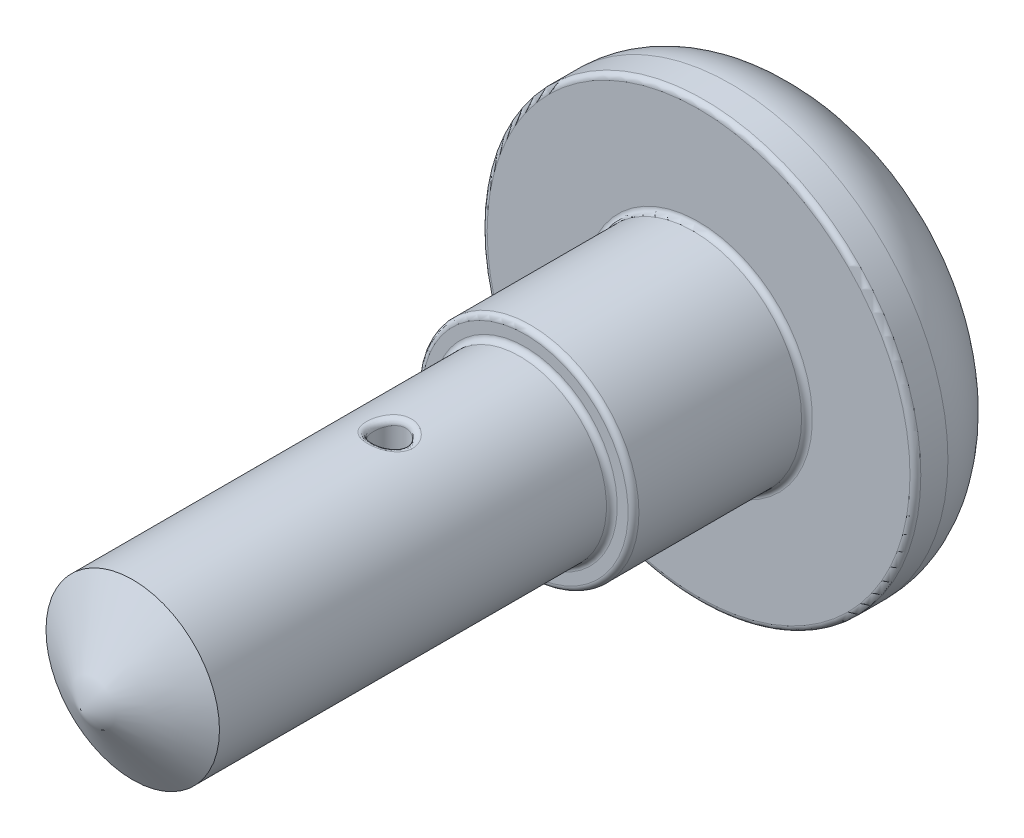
ISO-10303-21;
HEADER;
FILE_DESCRIPTION(('STEP AP214'),'2;1');
FILE_NAME('part.step','',(''),(''),'','','');
FILE_SCHEMA(('AUTOMOTIVE_DESIGN { 1 0 10303 214 1 1 1 1 }'));
ENDSEC;
DATA;
#1=APPLICATION_CONTEXT('core data for automotive mechanical design processes');
#2=APPLICATION_PROTOCOL_DEFINITION('international standard','automotive_design',2000,#1);
#3=PRODUCT_CONTEXT('',#1,'mechanical');
#4=PRODUCT('Part','Part','',(#3));
#5=PRODUCT_RELATED_PRODUCT_CATEGORY('part','',(#4));
#6=PRODUCT_DEFINITION_FORMATION('','',#4);
#7=PRODUCT_DEFINITION_CONTEXT('part definition',#1,'design');
#8=PRODUCT_DEFINITION('design','',#6,#7);
#9=PRODUCT_DEFINITION_SHAPE('','',#8);
#10=(LENGTH_UNIT() NAMED_UNIT(*) SI_UNIT(.MILLI.,.METRE.));
#11=(NAMED_UNIT(*) PLANE_ANGLE_UNIT() SI_UNIT($,.RADIAN.));
#12=(NAMED_UNIT(*) SI_UNIT($,.STERADIAN.) SOLID_ANGLE_UNIT());
#13=UNCERTAINTY_MEASURE_WITH_UNIT(LENGTH_MEASURE(1.E-05),#10,'distance_accuracy_value','');
#14=(GEOMETRIC_REPRESENTATION_CONTEXT(3) GLOBAL_UNCERTAINTY_ASSIGNED_CONTEXT((#13)) GLOBAL_UNIT_ASSIGNED_CONTEXT((#10,
#11,#12)) REPRESENTATION_CONTEXT('',''));
#15=CARTESIAN_POINT('',(0.,0.,0.));
#16=DIRECTION('',(0.,0.,1.));
#17=DIRECTION('',(1.,0.,0.));
#18=AXIS2_PLACEMENT_3D('',#15,#16,#17);
#19=CARTESIAN_POINT('',(0.,0.,-2.40344247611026));
#20=DIRECTION('',(0.,0.,-1.));
#21=DIRECTION('',(-1.,0.,0.));
#22=AXIS2_PLACEMENT_3D('',#19,#20,#21);
#23=CONICAL_SURFACE('',#22,4.,1.02974425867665);
#24=CARTESIAN_POINT('',(0.,0.,0.));
#25=VERTEX_POINT('',#24);
#26=VERTEX_LOOP('',#25);
#27=FACE_BOUND('',#26,.T.);
#28=CARTESIAN_POINT('',(0.,0.,-2.40344247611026));
#29=DIRECTION('',(0.,0.,1.));
#30=DIRECTION('',(1.,0.,0.));
#31=AXIS2_PLACEMENT_3D('',#28,#29,#30);
#32=CIRCLE('',#31,4.);
#33=CARTESIAN_POINT('',(4.,0.,-2.40344247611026));
#34=VERTEX_POINT('',#33);
#35=EDGE_CURVE('E53',#34,#34,#32,.T.);
#36=ORIENTED_EDGE('',*,*,#35,.T.);
#37=EDGE_LOOP('',(#36));
#38=FACE_BOUND('',#37,.T.);
#39=ADVANCED_FACE('F31',(#27,#38),#23,.T.);
#40=CARTESIAN_POINT('',(0.,0.,-28.));
#41=DIRECTION('',(0.,0.,1.));
#42=DIRECTION('',(1.,0.,0.));
#43=AXIS2_PLACEMENT_3D('',#40,#41,#42);
#44=PLANE('',#43);
#45=CARTESIAN_POINT('',(0.,0.,-28.));
#46=DIRECTION('',(0.,0.,1.));
#47=DIRECTION('',(1.,0.,0.));
#48=AXIS2_PLACEMENT_3D('',#45,#46,#47);
#49=CIRCLE('',#48,1.5);
#50=CARTESIAN_POINT('',(1.5,0.,-28.));
#51=VERTEX_POINT('',#50);
#52=EDGE_CURVE('E86',#51,#51,#49,.F.);
#53=ORIENTED_EDGE('',*,*,#52,.T.);
#54=EDGE_LOOP('',(#53));
#55=FACE_BOUND('',#54,.T.);
#56=ADVANCED_FACE('F49',(#55),#44,.F.);
#57=CARTESIAN_POINT('',(0.,0.,0.));
#58=DIRECTION('',(0.,0.,1.));
#59=DIRECTION('',(1.,0.,0.));
#60=AXIS2_PLACEMENT_3D('',#57,#58,#59);
#61=CYLINDRICAL_SURFACE('',#60,1.75);
#62=CARTESIAN_POINT('',(0.,0.,-28.25));
#63=DIRECTION('',(0.,0.,1.));
#64=DIRECTION('',(1.,0.,0.));
#65=AXIS2_PLACEMENT_3D('',#62,#63,#64);
#66=CIRCLE('',#65,1.75);
#67=CARTESIAN_POINT('',(1.75,0.,-28.25));
#68=VERTEX_POINT('',#67);
#69=EDGE_CURVE('E83',#68,#68,#66,.T.);
#70=ORIENTED_EDGE('',*,*,#69,.T.);
#71=EDGE_LOOP('',(#70));
#72=FACE_BOUND('',#71,.T.);
#73=CARTESIAN_POINT('',(0.,0.,-34.74766080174));
#74=DIRECTION('',(0.,0.,-1.));
#75=DIRECTION('',(-1.,0.,0.));
#76=AXIS2_PLACEMENT_3D('',#73,#74,#75);
#77=CIRCLE('',#76,1.75);
#78=CARTESIAN_POINT('',(-1.75,0.,-34.74766080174));
#79=VERTEX_POINT('',#78);
#80=EDGE_CURVE('E80',#79,#79,#77,.T.);
#81=ORIENTED_EDGE('',*,*,#80,.T.);
#82=EDGE_LOOP('',(#81));
#83=FACE_BOUND('',#82,.T.);
#84=ADVANCED_FACE('F171',(#72,#83),#61,.F.);
#85=CARTESIAN_POINT('',(0.,1.75,-30.));
#86=DIRECTION('',(1.,0.,0.));
#87=DIRECTION('',(0.,1.,0.));
#88=AXIS2_PLACEMENT_3D('',#85,#86,#87);
#89=ELLIPSE('',#88,8.25,5.);
#90=TRIMMED_CURVE('',#89,(PARAMETER_VALUE(4.49864392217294)),
(PARAMETER_VALUE(8.06772669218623)),.T.,.PARAMETER.);
#91=CARTESIAN_POINT('',(0.,0.,0.));
#92=DIRECTION('',(0.,0.,1.));
#93=AXIS1_PLACEMENT('',#91,#92);
#94=SURFACE_OF_REVOLUTION('',#90,#93);
#95=CARTESIAN_POINT('',(0.,0.,-34.9976170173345));
#96=DIRECTION('',(0.,0.,1.));
#97=DIRECTION('',(1.,0.,0.));
#98=AXIS2_PLACEMENT_3D('',#95,#96,#97);
#99=CIRCLE('',#98,2.00467870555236);
#100=CARTESIAN_POINT('',(2.00467870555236,0.,-34.9976170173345));
#101=VERTEX_POINT('',#100);
#102=EDGE_CURVE('E89',#101,#101,#99,.T.);
#103=ORIENTED_EDGE('',*,*,#102,.T.);
#104=EDGE_LOOP('',(#103));
#105=FACE_BOUND('',#104,.T.);
#106=CARTESIAN_POINT('',(0.,0.,-30.));
#107=DIRECTION('',(0.,0.,1.));
#108=DIRECTION('',(1.,0.,0.));
#109=AXIS2_PLACEMENT_3D('',#106,#107,#108);
#110=CIRCLE('',#109,10.);
#111=CARTESIAN_POINT('',(10.,0.,-30.));
#112=VERTEX_POINT('',#111);
#113=EDGE_CURVE('E55',#112,#112,#110,.T.);
#114=ORIENTED_EDGE('',*,*,#113,.F.);
#115=EDGE_LOOP('',(#114));
#116=FACE_BOUND('',#115,.T.);
#117=ADVANCED_FACE('F174',(#105,#116),#94,.T.);
#118=CARTESIAN_POINT('',(0.,0.,0.));
#119=DIRECTION('',(0.,0.,1.));
#120=DIRECTION('',(1.,0.,0.));
#121=AXIS2_PLACEMENT_3D('',#118,#119,#120);
#122=CYLINDRICAL_SURFACE('',#121,10.);
#123=CARTESIAN_POINT('',(0.,0.,-28.75));
#124=DIRECTION('',(0.,0.,-1.));
#125=DIRECTION('',(-1.,0.,0.));
#126=AXIS2_PLACEMENT_3D('',#123,#124,#125);
#127=CIRCLE('',#126,10.);
#128=CARTESIAN_POINT('',(-10.,0.,-28.75));
#129=VERTEX_POINT('',#128);
#130=EDGE_CURVE('E11',#129,#129,#127,.T.);
#131=ORIENTED_EDGE('',*,*,#130,.T.);
#132=EDGE_LOOP('',(#131));
#133=FACE_BOUND('',#132,.T.);
#134=ORIENTED_EDGE('',*,*,#113,.T.);
#135=EDGE_LOOP('',(#134));
#136=FACE_BOUND('',#135,.T.);
#137=ADVANCED_FACE('F182',(#133,#136),#122,.T.);
#138=CARTESIAN_POINT('',(0.,5.,-28.5));
#139=DIRECTION('',(0.,0.,-1.));
#140=DIRECTION('',(-1.,0.,0.));
#141=AXIS2_PLACEMENT_3D('',#138,#139,#140);
#142=PLANE('',#141);
#143=CARTESIAN_POINT('',(0.,0.,-28.5));
#144=DIRECTION('',(0.,0.,-1.));
#145=DIRECTION('',(-1.,0.,0.));
#146=AXIS2_PLACEMENT_3D('',#143,#144,#145);
#147=CIRCLE('',#146,5.25);
#148=CARTESIAN_POINT('',(-5.25,0.,-28.5));
#149=VERTEX_POINT('',#148);
#150=EDGE_CURVE('E71',#149,#149,#147,.T.);
#151=ORIENTED_EDGE('',*,*,#150,.T.);
#152=EDGE_LOOP('',(#151));
#153=FACE_BOUND('',#152,.T.);
#154=CARTESIAN_POINT('',(0.,0.,-28.5));
#155=DIRECTION('',(0.,0.,-1.));
#156=DIRECTION('',(-1.,0.,0.));
#157=AXIS2_PLACEMENT_3D('',#154,#155,#156);
#158=CIRCLE('',#157,9.75);
#159=CARTESIAN_POINT('',(-9.75,0.,-28.5));
#160=VERTEX_POINT('',#159);
#161=EDGE_CURVE('E68',#160,#160,#158,.F.);
#162=ORIENTED_EDGE('',*,*,#161,.T.);
#163=EDGE_LOOP('',(#162));
#164=FACE_BOUND('',#163,.T.);
#165=ADVANCED_FACE('F187',(#153,#164),#142,.F.);
#166=CARTESIAN_POINT('',(0.,0.,0.));
#167=DIRECTION('',(0.,0.,1.));
#168=DIRECTION('',(1.,0.,0.));
#169=AXIS2_PLACEMENT_3D('',#166,#167,#168);
#170=CYLINDRICAL_SURFACE('',#169,5.);
#171=CARTESIAN_POINT('',(0.,0.,-28.25));
#172=DIRECTION('',(0.,0.,-1.));
#173=DIRECTION('',(-1.,0.,0.));
#174=AXIS2_PLACEMENT_3D('',#171,#172,#173);
#175=CIRCLE('',#174,5.);
#176=CARTESIAN_POINT('',(-5.,0.,-28.25));
#177=VERTEX_POINT('',#176);
#178=EDGE_CURVE('E65',#177,#177,#175,.F.);
#179=ORIENTED_EDGE('',*,*,#178,.T.);
#180=EDGE_LOOP('',(#179));
#181=FACE_BOUND('',#180,.T.);
#182=CARTESIAN_POINT('',(0.,0.,-20.75));
#183=DIRECTION('',(0.,0.,-1.));
#184=DIRECTION('',(-1.,0.,0.));
#185=AXIS2_PLACEMENT_3D('',#182,#183,#184);
#186=CIRCLE('',#185,5.);
#187=CARTESIAN_POINT('',(-5.,0.,-20.75));
#188=VERTEX_POINT('',#187);
#189=EDGE_CURVE('E58',#188,#188,#186,.T.);
#190=ORIENTED_EDGE('',*,*,#189,.T.);
#191=EDGE_LOOP('',(#190));
#192=FACE_BOUND('',#191,.T.);
#193=ADVANCED_FACE('F193',(#181,#192),#170,.T.);
#194=CARTESIAN_POINT('',(0.,5.,-20.5));
#195=DIRECTION('',(0.,0.,-1.));
#196=DIRECTION('',(-1.,0.,0.));
#197=AXIS2_PLACEMENT_3D('',#194,#195,#196);
#198=PLANE('',#197);
#199=CARTESIAN_POINT('',(0.,0.,-20.5));
#200=DIRECTION('',(0.,0.,-1.));
#201=DIRECTION('',(-1.,0.,0.));
#202=AXIS2_PLACEMENT_3D('',#199,#200,#201);
#203=CIRCLE('',#202,4.75);
#204=CARTESIAN_POINT('',(-4.75,0.,-20.5));
#205=VERTEX_POINT('',#204);
#206=EDGE_CURVE('E77',#205,#205,#203,.F.);
#207=ORIENTED_EDGE('',*,*,#206,.T.);
#208=EDGE_LOOP('',(#207));
#209=FACE_BOUND('',#208,.T.);
#210=CARTESIAN_POINT('',(0.,0.,-20.5));
#211=DIRECTION('',(0.,0.,-1.));
#212=DIRECTION('',(-1.,0.,0.));
#213=AXIS2_PLACEMENT_3D('',#210,#211,#212);
#214=CIRCLE('',#213,4.25);
#215=CARTESIAN_POINT('',(-4.25,0.,-20.5));
#216=VERTEX_POINT('',#215);
#217=EDGE_CURVE('E74',#216,#216,#214,.T.);
#218=ORIENTED_EDGE('',*,*,#217,.T.);
#219=EDGE_LOOP('',(#218));
#220=FACE_BOUND('',#219,.T.);
#221=ADVANCED_FACE('F230',(#209,#220),#198,.F.);
#222=CARTESIAN_POINT('',(0.,0.,0.));
#223=DIRECTION('',(0.,0.,1.));
#224=DIRECTION('',(1.,0.,0.));
#225=AXIS2_PLACEMENT_3D('',#222,#223,#224);
#226=CYLINDRICAL_SURFACE('',#225,4.);
#227=CARTESIAN_POINT('',(-0.195879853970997,-3.74089408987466,-13.5260310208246));
#228=CARTESIAN_POINT('',(-0.212404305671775,-3.99490745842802,-13.5305019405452));
#229=CARTESIAN_POINT('',(-0.278584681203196,-3.99028702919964,-13.2847080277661));
#230=CARTESIAN_POINT('',(-0.155399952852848,-3.74466208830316,-13.5150786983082));
#231=CARTESIAN_POINT('',(-0.169050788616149,-3.99697783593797,-13.5177849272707));
#232=CARTESIAN_POINT('',(-0.221013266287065,-3.99430622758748,-13.2701049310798));
#233=CARTESIAN_POINT('',(-0.113944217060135,-3.7473366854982,-13.5075158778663));
#234=CARTESIAN_POINT('',(-0.124016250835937,-3.99849396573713,-13.508848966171));
#235=CARTESIAN_POINT('',(-0.162053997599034,-3.99715913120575,-13.2600211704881));
#236=CARTESIAN_POINT('',(-0.0303069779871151,-3.75019672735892,-13.499436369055));
#237=CARTESIAN_POINT('',(-0.0331003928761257,-4.00010842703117,-13.4993473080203));
#238=CARTESIAN_POINT('',(-0.0431032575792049,-4.00020984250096,-13.2492484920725));
#239=CARTESIAN_POINT('',(0.011874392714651,-3.75038262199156,-13.4989184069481));
#240=CARTESIAN_POINT('',(0.013004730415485,-4.00021509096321,-13.4987324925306));
#241=CARTESIAN_POINT('',(0.0168880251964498,-4.00040813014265,-13.2485578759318));
#242=CARTESIAN_POINT('',(0.0945300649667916,-3.74827555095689,-13.5048598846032));
#243=CARTESIAN_POINT('',(0.102917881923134,-3.99902399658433,-13.5057232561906));
#244=CARTESIAN_POINT('',(0.134442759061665,-3.99816058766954,-13.2564798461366));
#245=CARTESIAN_POINT('',(0.135019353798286,-3.74605084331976,-13.5111271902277));
#246=CARTESIAN_POINT('',(0.146968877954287,-3.99775924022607,-13.5131357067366));
#247=CARTESIAN_POINT('',(0.192027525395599,-3.99578756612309,-13.2648362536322));
#248=CARTESIAN_POINT('',(0.21439817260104,-3.73946493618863,-13.5301379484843));
#249=CARTESIAN_POINT('',(0.232539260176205,-3.99410591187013,-13.5353428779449));
#250=CARTESIAN_POINT('',(0.304921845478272,-3.98876259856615,-13.2901839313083));
#251=CARTESIAN_POINT('',(0.253285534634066,-3.73510093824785,-13.5428898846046));
#252=CARTESIAN_POINT('',(0.274226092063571,-3.99170026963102,-13.5502457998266));
#253=CARTESIAN_POINT('',(0.3602283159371,-3.98410766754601,-13.3071865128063));
#254=CARTESIAN_POINT('',(0.328596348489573,-3.72466236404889,-13.5745713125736));
#255=CARTESIAN_POINT('',(0.353862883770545,-3.98614158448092,-13.5866787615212));
#256=CARTESIAN_POINT('',(0.467337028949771,-3.97297318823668,-13.3494284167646));
#257=CARTESIAN_POINT('',(0.365003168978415,-3.71857742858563,-13.5935383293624));
#258=CARTESIAN_POINT('',(0.391888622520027,-3.98296585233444,-13.6083873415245));
#259=CARTESIAN_POINT('',(0.519115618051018,-3.96648259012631,-13.3747177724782));
#260=CARTESIAN_POINT('',(0.434171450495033,-3.70534126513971,-13.6370838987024));
#261=CARTESIAN_POINT('',(0.462828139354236,-3.97636582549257,-13.6572327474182));
#262=CARTESIAN_POINT('',(0.617488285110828,-3.95236401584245,-13.4327785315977));
#263=CARTESIAN_POINT('',(0.466932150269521,-3.69818981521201,-13.661663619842));
#264=CARTESIAN_POINT('',(0.495757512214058,-3.97292950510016,-13.6845109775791));
#265=CARTESIAN_POINT('',(0.664081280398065,-3.94473580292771,-13.4655514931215));
#266=CARTESIAN_POINT('',(0.528965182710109,-3.68332638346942,-13.7166456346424));
#267=CARTESIAN_POINT('',(0.556741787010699,-3.9661826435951,-13.7440975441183));
#268=CARTESIAN_POINT('',(0.752306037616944,-3.92888147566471,-13.5388608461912));
#269=CARTESIAN_POINT('',(0.558095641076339,-3.67560385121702,-13.7472065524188));
#270=CARTESIAN_POINT('',(0.584524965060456,-3.96288155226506,-13.7766285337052));
#271=CARTESIAN_POINT('',(0.793736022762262,-3.92064410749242,-13.5796087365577));
#272=CARTESIAN_POINT('',(0.610818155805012,-3.66067016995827,-13.8127718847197));
#273=CARTESIAN_POINT('',(0.633506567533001,-3.95693163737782,-13.8444882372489));
#274=CARTESIAN_POINT('',(0.868719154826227,-3.90471484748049,-13.6670291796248));
#275=CARTESIAN_POINT('',(0.634417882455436,-3.65345832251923,-13.8477700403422));
#276=CARTESIAN_POINT('',(0.654578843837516,-3.95429573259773,-13.879836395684));
#277=CARTESIAN_POINT('',(0.902283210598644,-3.89702221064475,-13.7136933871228));
#278=CARTESIAN_POINT('',(0.675678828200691,-3.64028593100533,-13.9217186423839));
#279=CARTESIAN_POINT('',(0.690479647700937,-3.94983394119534,-13.9524184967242));
#280=CARTESIAN_POINT('',(0.960965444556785,-3.88297165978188,-13.8122915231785));
#281=CARTESIAN_POINT('',(0.693276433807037,-3.63433902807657,-13.9607060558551));
#282=CARTESIAN_POINT('',(0.705077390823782,-3.94803765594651,-13.9895776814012));
#283=CARTESIAN_POINT('',(0.985993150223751,-3.8766282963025,-13.8642747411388));
#284=CARTESIAN_POINT('',(0.721621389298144,-3.62451783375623,-14.0412335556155));
#285=CARTESIAN_POINT('',(0.72814361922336,-3.94526174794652,-14.0644731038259));
#286=CARTESIAN_POINT('',(1.02630597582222,-3.8661523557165,-13.9716447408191));
#287=CARTESIAN_POINT('',(0.732370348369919,-3.62064305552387,-14.0827730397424));
#288=CARTESIAN_POINT('',(0.736477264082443,-3.94429932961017,-14.1020246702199));
#289=CARTESIAN_POINT('',(1.04159338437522,-3.86201925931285,-14.0270307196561));
#290=CARTESIAN_POINT('',(0.746437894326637,-3.61553164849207,-14.165974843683));
#291=CARTESIAN_POINT('',(0.747345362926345,-3.94306175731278,-14.176271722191));
#292=CARTESIAN_POINT('',(1.06160056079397,-3.85656709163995,-14.1379664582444));
#293=CARTESIAN_POINT('',(0.749957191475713,-3.61422380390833,-14.2076007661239));
#294=CARTESIAN_POINT('',(0.749967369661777,-3.94277605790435,-14.2127358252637));
#295=CARTESIAN_POINT('',(1.0666057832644,-3.85517205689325,-14.1934676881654));
#296=CARTESIAN_POINT('',(0.750042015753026,-3.61419263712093,-14.2908570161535));
#297=CARTESIAN_POINT('',(0.75003203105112,-3.94276889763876,-14.285910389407));
#298=CARTESIAN_POINT('',(1.06672642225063,-3.85513881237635,-14.3044760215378));
#299=CARTESIAN_POINT('',(0.746608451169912,-3.61546897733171,-14.3324873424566));
#300=CARTESIAN_POINT('',(0.747474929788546,-3.94304741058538,-14.3223722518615));
#301=CARTESIAN_POINT('',(1.0618431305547,-3.85650024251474,-14.3599831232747));
#302=CARTESIAN_POINT('',(0.733071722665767,-3.62038885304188,-14.4135765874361));
#303=CARTESIAN_POINT('',(0.737018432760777,-3.94423737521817,-14.394717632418));
#304=CARTESIAN_POINT('',(1.04259089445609,-3.86174810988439,-14.4681021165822));
#305=CARTESIAN_POINT('',(0.723123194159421,-3.62397747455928,-14.453063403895));
#306=CARTESIAN_POINT('',(0.729307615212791,-3.9451266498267,-14.4303734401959));
#307=CARTESIAN_POINT('',(1.02844187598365,-3.86557597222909,-14.520751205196));
#308=CARTESIAN_POINT('',(0.697010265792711,-3.63306152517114,-14.5298661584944));
#309=CARTESIAN_POINT('',(0.708142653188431,-3.94766499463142,-14.5015814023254));
#310=CARTESIAN_POINT('',(0.991303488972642,-3.87526562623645,-14.6231548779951));
#311=CARTESIAN_POINT('',(0.680834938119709,-3.63856030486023,-14.5671781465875));
#312=CARTESIAN_POINT('',(0.694792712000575,-3.94930088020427,-14.5369710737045));
#313=CARTESIAN_POINT('',(0.968298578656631,-3.88113099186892,-14.6729041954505));
#314=CARTESIAN_POINT('',(0.64239529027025,-3.65096787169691,-14.6392652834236));
#315=CARTESIAN_POINT('',(0.66161043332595,-3.95341987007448,-14.6072744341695));
#316=CARTESIAN_POINT('',(0.913628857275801,-3.89436572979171,-14.7690203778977));
#317=CARTESIAN_POINT('',(0.62002493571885,-3.65790062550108,-14.6739814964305));
#318=CARTESIAN_POINT('',(0.64180466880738,-3.95589980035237,-14.6420902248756));
#319=CARTESIAN_POINT('',(0.881813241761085,-3.90176066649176,-14.8153086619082));
#320=CARTESIAN_POINT('',(0.569941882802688,-3.67235375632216,-14.7392429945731));
#321=CARTESIAN_POINT('',(0.595666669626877,-3.96154309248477,-14.7091749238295));
#322=CARTESIAN_POINT('',(0.810584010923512,-3.91717733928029,-14.9023239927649));
#323=CARTESIAN_POINT('',(0.542228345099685,-3.67987422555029,-14.7697876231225));
#324=CARTESIAN_POINT('',(0.569465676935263,-3.96469230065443,-14.7414520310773));
#325=CARTESIAN_POINT('',(0.771169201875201,-3.92519917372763,-14.9430501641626));
#326=CARTESIAN_POINT('',(0.481235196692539,-3.69493553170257,-14.8268089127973));
#327=CARTESIAN_POINT('',(0.510014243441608,-3.97140268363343,-14.8028141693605));
#328=CARTESIAN_POINT('',(0.684423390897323,-3.94126456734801,-15.0190785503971));
#329=CARTESIAN_POINT('',(0.447810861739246,-3.702469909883,-14.8531319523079));
#330=CARTESIAN_POINT('',(0.476640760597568,-3.9749725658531,-14.8318848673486));
#331=CARTESIAN_POINT('',(0.636886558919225,-3.94930123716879,-15.0541759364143));
#332=CARTESIAN_POINT('',(0.376917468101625,-3.71647858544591,-14.8997938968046));
#333=CARTESIAN_POINT('',(0.404265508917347,-3.98188754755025,-14.8840283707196));
#334=CARTESIAN_POINT('',(0.536060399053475,-3.96424382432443,-15.1163918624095));
#335=CARTESIAN_POINT('',(0.339450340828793,-3.72295338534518,-14.9201356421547));
#336=CARTESIAN_POINT('',(0.365260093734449,-3.9852446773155,-14.9072578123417));
#337=CARTESIAN_POINT('',(0.482773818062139,-3.97115027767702,-15.1435141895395));
#338=CARTESIAN_POINT('',(0.2666661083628,-3.73338166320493,-14.951962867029));
#339=CARTESIAN_POINT('',(0.288408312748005,-3.99077642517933,-14.9438222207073));
#340=CARTESIAN_POINT('',(0.379258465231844,-3.98227377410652,-15.1859504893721));
#341=CARTESIAN_POINT('',(0.231721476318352,-3.73755549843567,-14.9642644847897));
#342=CARTESIAN_POINT('',(0.251068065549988,-3.99305951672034,-14.9581481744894));
#343=CARTESIAN_POINT('',(0.329559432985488,-3.98672586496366,-15.2023526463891));
#344=CARTESIAN_POINT('',(0.160318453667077,-3.7442065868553,-14.9835976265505));
#345=CARTESIAN_POINT('',(0.174301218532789,-3.99672860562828,-14.9806833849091));
#346=CARTESIAN_POINT('',(0.228008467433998,-3.99382035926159,-15.2281301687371));
#347=CARTESIAN_POINT('',(0.123860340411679,-3.74668414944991,-14.9906301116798));
#348=CARTESIAN_POINT('',(0.134755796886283,-3.99812715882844,-14.9889739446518));
#349=CARTESIAN_POINT('',(0.176156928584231,-3.99646309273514,-15.2375068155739));
#350=CARTESIAN_POINT('',(0.0462959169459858,-3.74988536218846,-14.9996928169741));
#351=CARTESIAN_POINT('',(0.0505181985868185,-3.99993065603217,-14.9996220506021));
#352=CARTESIAN_POINT('',(0.0658430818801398,-3.99987771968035,-15.2495904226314));
#353=CARTESIAN_POINT('',(0.00511071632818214,-3.75039221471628,-15.0011051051));
#354=CARTESIAN_POINT('',(0.00551871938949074,-4.0002215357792,-15.0012988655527));
#355=CARTESIAN_POINT('',(0.00726857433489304,-4.00041836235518,-15.251473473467));
#356=CARTESIAN_POINT('',(-0.0769211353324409,-3.7489965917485,-14.9971749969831));
#357=CARTESIAN_POINT('',(-0.0837638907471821,-3.99943171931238,-14.9966725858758));
#358=CARTESIAN_POINT('',(-0.10939894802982,-3.998929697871,-15.2462333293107));
#359=CARTESIAN_POINT('',(-0.117767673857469,-3.74709334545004,-14.9918304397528));
#360=CARTESIAN_POINT('',(-0.128261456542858,-3.99834675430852,-14.9903445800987));
#361=CARTESIAN_POINT('',(-0.167491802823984,-3.99689956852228,-15.2391072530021));
#362=CARTESIAN_POINT('',(-0.197886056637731,-3.74108848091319,-14.9745810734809));
#363=CARTESIAN_POINT('',(-0.214790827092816,-3.99500262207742,-14.970164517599));
#364=CARTESIAN_POINT('',(-0.281437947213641,-3.99049437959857,-15.2161080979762));
#365=CARTESIAN_POINT('',(-0.237160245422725,-3.73699027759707,-14.9626864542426));
#366=CARTESIAN_POINT('',(-0.25700712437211,-3.99273056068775,-14.956232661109));
#367=CARTESIAN_POINT('',(-0.337294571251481,-3.98612296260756,-15.2002486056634));
#368=CARTESIAN_POINT('',(-0.313191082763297,-3.72702573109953,-14.932703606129));
#369=CARTESIAN_POINT('',(-0.337670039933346,-3.98738685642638,-14.9216608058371));
#370=CARTESIAN_POINT('',(-0.445427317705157,-3.97549411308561,-15.1602714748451));
#371=CARTESIAN_POINT('',(-0.349944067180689,-3.72115687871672,-14.9146065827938));
#372=CARTESIAN_POINT('',(-0.376224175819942,-3.98429564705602,-14.9008760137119));
#373=CARTESIAN_POINT('',(-0.497698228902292,-3.96923400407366,-15.1361421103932));
#374=CARTESIAN_POINT('',(-0.42046932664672,-3.70816503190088,-14.8724301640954));
#375=CARTESIAN_POINT('',(-0.448923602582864,-3.97774649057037,-14.8533694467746));
#376=CARTESIAN_POINT('',(-0.598000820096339,-3.95537603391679,-15.0799068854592));
#377=CARTESIAN_POINT('',(-0.454187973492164,-3.70102437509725,-14.8482642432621));
#378=CARTESIAN_POINT('',(-0.483015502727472,-3.97427061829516,-14.8264201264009));
#379=CARTESIAN_POINT('',(-0.645956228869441,-3.94775933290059,-15.047685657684));
#380=CARTESIAN_POINT('',(-0.517163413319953,-3.68630429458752,-14.7947477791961));
#381=CARTESIAN_POINT('',(-0.545291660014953,-3.96749775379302,-14.768146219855));
#382=CARTESIAN_POINT('',(-0.735521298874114,-3.9320579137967,-14.976330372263));
#383=CARTESIAN_POINT('',(-0.546419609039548,-3.67872481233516,-14.7653965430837));
#384=CARTESIAN_POINT('',(-0.573417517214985,-3.96419935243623,-14.7367105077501));
#385=CARTESIAN_POINT('',(-0.777130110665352,-3.92397313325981,-14.9371953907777));
#386=CARTESIAN_POINT('',(-0.600476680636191,-3.66372462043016,-14.7013662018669));
#387=CARTESIAN_POINT('',(-0.624088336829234,-3.95809766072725,-14.6699550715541));
#388=CARTESIAN_POINT('',(-0.854011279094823,-3.90797292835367,-14.8518216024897));
#389=CARTESIAN_POINT('',(-0.625130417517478,-3.65631424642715,-14.6665612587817));
#390=CARTESIAN_POINT('',(-0.646311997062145,-3.95532474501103,-14.6345305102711));
#391=CARTESIAN_POINT('',(-0.889074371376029,-3.90006852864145,-14.805415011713));
#392=CARTESIAN_POINT('',(-0.668205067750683,-3.6427460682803,-14.5932303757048));
#393=CARTESIAN_POINT('',(-0.684124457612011,-3.95062263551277,-14.5620400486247));
#394=CARTESIAN_POINT('',(-0.950336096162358,-3.88559580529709,-14.7076405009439));
#395=CARTESIAN_POINT('',(-0.686635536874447,-3.63658634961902,-14.5547102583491));
#396=CARTESIAN_POINT('',(-0.699562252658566,-3.94871250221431,-14.5250461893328));
#397=CARTESIAN_POINT('',(-0.976548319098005,-3.87902543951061,-14.6562803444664));
#398=CARTESIAN_POINT('',(-0.716613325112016,-3.626289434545,-14.4752829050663));
#399=CARTESIAN_POINT('',(-0.724158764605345,-3.94573322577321,-14.4506832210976));
#400=CARTESIAN_POINT('',(-1.01918339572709,-3.86804206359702,-14.5503772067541));
#401=CARTESIAN_POINT('',(-0.728214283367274,-3.62213652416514,-14.4343971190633));
#402=CARTESIAN_POINT('',(-0.733228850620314,-3.9446752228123,-14.4134846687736));
#403=CARTESIAN_POINT('',(-1.03568253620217,-3.86361229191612,-14.4958628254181));
#404=CARTESIAN_POINT('',(-0.744353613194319,-3.61630023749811,-14.3511616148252));
#405=CARTESIAN_POINT('',(-0.745771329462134,-3.94323642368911,-14.3388664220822));
#406=CARTESIAN_POINT('',(-1.05863624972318,-3.85738691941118,-14.3848821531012));
#407=CARTESIAN_POINT('',(-0.748893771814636,-3.61461623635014,-14.3088122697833));
#408=CARTESIAN_POINT('',(-0.749162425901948,-3.94286521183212,-14.3016833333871));
#409=CARTESIAN_POINT('',(-1.06509336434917,-3.85559065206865,-14.3284163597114));
#410=CARTESIAN_POINT('',(-0.75071802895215,-3.61394310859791,-14.2253395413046));
#411=CARTESIAN_POINT('',(-0.750544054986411,-3.94271217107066,-14.2282994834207));
#412=CARTESIAN_POINT('',(-1.06768786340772,-3.85487264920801,-14.2171193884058));
#413=CARTESIAN_POINT('',(-0.748235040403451,-3.61486747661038,-14.1842214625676));
#414=CARTESIAN_POINT('',(-0.748698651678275,-3.94291244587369,-14.1923475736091));
#415=CARTESIAN_POINT('',(-1.06415650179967,-3.85585864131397,-14.1622952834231));
#416=CARTESIAN_POINT('',(-0.736598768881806,-3.61911327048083,-14.1030144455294));
#417=CARTESIAN_POINT('',(-0.739754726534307,-3.94392371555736,-14.1201755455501));
#418=CARTESIAN_POINT('',(-1.04760713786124,-3.86038748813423,-14.0540192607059));
#419=CARTESIAN_POINT('',(-0.72744553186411,-3.62243467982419,-14.0629255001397));
#420=CARTESIAN_POINT('',(-0.732712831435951,-3.94472821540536,-14.0841802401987));
#421=CARTESIAN_POINT('',(-1.03458920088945,-3.86393032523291,-14.0005673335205));
#422=CARTESIAN_POINT('',(-0.702842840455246,-3.63105798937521,-13.9851063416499));
#423=CARTESIAN_POINT('',(-0.712921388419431,-3.94708581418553,-14.0124646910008));
#424=CARTESIAN_POINT('',(-0.999598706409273,-3.87312852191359,-13.8968084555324));
#425=CARTESIAN_POINT('',(-0.687428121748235,-3.6363489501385,-13.9473644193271));
#426=CARTESIAN_POINT('',(-0.700313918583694,-3.94862087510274,-13.9769195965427));
#427=CARTESIAN_POINT('',(-0.977675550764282,-3.87877221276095,-13.846485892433));
#428=CARTESIAN_POINT('',(-0.650740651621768,-3.64832956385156,-13.8749156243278));
#429=CARTESIAN_POINT('',(-0.668909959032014,-3.9525103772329,-13.9067396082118));
#430=CARTESIAN_POINT('',(-0.925497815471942,-3.89155153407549,-13.7498874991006));
#431=CARTESIAN_POINT('',(-0.629459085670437,-3.65502131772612,-13.8402134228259));
#432=CARTESIAN_POINT('',(-0.650242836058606,-3.95484810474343,-13.8722010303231));
#433=CARTESIAN_POINT('',(-0.895230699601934,-3.89868940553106,-13.7036178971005));
#434=CARTESIAN_POINT('',(-0.580899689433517,-3.66929520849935,-13.773765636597));
#435=CARTESIAN_POINT('',(-0.605914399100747,-3.96030214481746,-13.8044027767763));
#436=CARTESIAN_POINT('',(-0.826168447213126,-3.91391488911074,-13.6150208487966));
#437=CARTESIAN_POINT('',(-0.55346114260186,-3.6768980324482,-13.7421399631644));
#438=CARTESIAN_POINT('',(-0.580189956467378,-3.96342517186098,-13.7712003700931));
#439=CARTESIAN_POINT('',(-0.787144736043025,-3.92202456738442,-13.5728532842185));
#440=CARTESIAN_POINT('',(-0.493705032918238,-3.69199369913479,-13.6838753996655));
#441=CARTESIAN_POINT('',(-0.52231473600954,-3.97005164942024,-13.7088223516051));
#442=CARTESIAN_POINT('',(-0.702158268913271,-3.93812661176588,-13.4951671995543));
#443=CARTESIAN_POINT('',(-0.461387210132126,-3.69948653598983,-13.6572367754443));
#444=CARTESIAN_POINT('',(-0.49025445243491,-3.97355067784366,-13.679561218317));
#445=CARTESIAN_POINT('',(-0.656195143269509,-3.94611897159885,-13.4596490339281));
#446=CARTESIAN_POINT('',(-0.392014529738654,-3.71369462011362,-13.6091886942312));
#447=CARTESIAN_POINT('',(-0.419839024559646,-3.98047785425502,-13.6261206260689));
#448=CARTESIAN_POINT('',(-0.557531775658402,-3.9612742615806,-13.3955849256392));
#449=CARTESIAN_POINT('',(-0.354879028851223,-3.72039168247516,-13.5878923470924));
#450=CARTESIAN_POINT('',(-0.381369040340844,-3.98391445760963,-13.6018946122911));
#451=CARTESIAN_POINT('',(-0.504716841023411,-3.96841779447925,-13.3671897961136));
#452=CARTESIAN_POINT('',(-0.277457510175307,-3.73206807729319,-13.5519052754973));
#453=CARTESIAN_POINT('',(-0.299981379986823,-3.99005442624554,-13.5607091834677));
#454=CARTESIAN_POINT('',(-0.394606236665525,-3.98087261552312,-13.3192070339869));
#455=CARTESIAN_POINT('',(-0.237176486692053,-3.73705006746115,-13.537204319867));
#456=CARTESIAN_POINT('',(-0.256975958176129,-3.99277890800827,-13.5435762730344));
#457=CARTESIAN_POINT('',(-0.337317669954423,-3.98618673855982,-13.2996057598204));
#458=CARTESIAN_POINT('',(-0.195879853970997,-3.74089408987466,-13.5260310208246));
#459=CARTESIAN_POINT('',(-0.212404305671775,-3.99490745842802,-13.5305019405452));
#460=CARTESIAN_POINT('',(-0.278584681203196,-3.99028702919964,-13.2847080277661));
#461=(BOUNDED_SURFACE() B_SPLINE_SURFACE(3,2,((#227,#228,#229),(#230,#231,#232),(#233,#234,
#235),(#236,#237,#238),(#239,#240,#241),(#242,#243,#244),(#245,#246,#247),(#248,#249,#250),
(#251,#252,#253),(#254,#255,#256),(#257,#258,#259),(#260,#261,#262),(#263,#264,#265),(#266,#267,
#268),(#269,#270,#271),(#272,#273,#274),(#275,#276,#277),(#278,#279,#280),(#281,#282,#283),
(#284,#285,#286),(#287,#288,#289),(#290,#291,#292),(#293,#294,#295),(#296,#297,#298),(#299,#300,
#301),(#302,#303,#304),(#305,#306,#307),(#308,#309,#310),(#311,#312,#313),(#314,#315,#316),
(#317,#318,#319),(#320,#321,#322),(#323,#324,#325),(#326,#327,#328),(#329,#330,#331),(#332,#333,
#334),(#335,#336,#337),(#338,#339,#340),(#341,#342,#343),(#344,#345,#346),(#347,#348,#349),
(#350,#351,#352),(#353,#354,#355),(#356,#357,#358),(#359,#360,#361),(#362,#363,#364),(#365,#366,
#367),(#368,#369,#370),(#371,#372,#373),(#374,#375,#376),(#377,#378,#379),(#380,#381,#382),
(#383,#384,#385),(#386,#387,#388),(#389,#390,#391),(#392,#393,#394),(#395,#396,#397),(#398,#399,
#400),(#401,#402,#403),(#404,#405,#406),(#407,#408,#409),(#410,#411,#412),(#413,#414,#415),
(#416,#417,#418),(#419,#420,#421),(#422,#423,#424),(#425,#426,#427),(#428,#429,#430),(#431,#432,
#433),(#434,#435,#436),(#437,#438,#439),(#440,#441,#442),(#443,#444,#445),(#446,#447,#448),
(#449,#450,#451),(#452,#453,#454),(#455,#456,#457),(#458,#459,#460)),.UNSPECIFIED.,.T.,.F.,
.F.) B_SPLINE_SURFACE_WITH_KNOTS((4,2,2,2,2,2,2,2,2,2,2,2,2,2,2,2,2,2,2,2,2,2,2,2,2,2,2,2,2,2,2,
2,2,2,2,2,2,2,4),(3,3),(0.,0.167913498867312,0.335796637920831,0.499047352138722,
0.662512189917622,0.8269827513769,0.991487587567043,1.16115902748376,1.33059374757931,
1.50177214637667,1.67291030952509,1.83922935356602,2.00552667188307,2.1680133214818,
2.33078643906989,2.49653897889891,2.66231757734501,2.83318410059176,3.00396935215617,
3.15213502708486,3.30027366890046,3.46431263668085,3.62840408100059,3.79224096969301,
3.95631113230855,4.12286835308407,4.28944784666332,4.46067661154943,4.63164124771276,
4.80124456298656,4.97080494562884,5.13480865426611,5.29881123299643,5.46191616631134,
5.62526750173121,5.79351875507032,5.96177897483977,6.13334740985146,6.30464876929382),(0.,1.),
.UNSPECIFIED.) GEOMETRIC_REPRESENTATION_ITEM() RATIONAL_B_SPLINE_SURFACE(((1.,0.700646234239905,
1.),(1.,0.703328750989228,1.),(1.,0.705222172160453,1.),(1.,0.707246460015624,1.),(1.,
0.707377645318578,1.),(1.,0.705886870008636,1.),(1.,0.7043131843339,1.),(1.,0.699631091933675,
1.),(1.,0.696520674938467,1.),(1.,0.689027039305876,1.),(1.,0.68463610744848,1.),(1.,
0.674999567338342,1.),(1.,0.669753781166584,1.),(1.,0.658743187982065,1.),(1.,0.652967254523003,
1.),(1.,0.641684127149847,1.),(1.,0.636176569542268,1.),(1.,0.626028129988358,1.),(1.,
0.62139675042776,1.),(1.,0.613701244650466,1.),(1.,0.610636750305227,1.),(1.,0.606585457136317,
1.),(1.,0.605542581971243,1.),(1.,0.605517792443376,1.),(1.,0.60653560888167,1.),(1.,
0.610435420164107,1.),(1.,0.613274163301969,1.),(1.,0.620398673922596,1.),(1.,0.624686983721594,
1.),(1.,0.634266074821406,1.),(1.,0.639573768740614,1.),(1.,0.65052334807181,1.),(1.,
0.656165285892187,1.),(1.,0.667356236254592,1.),(1.,0.672897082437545,1.),(1.,0.683116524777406,
1.),(1.,0.687795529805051,1.),(1.,0.695289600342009,1.),(1.,0.698269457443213,1.),(1.,
0.703004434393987,1.),(1.,0.704759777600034,1.),(1.,0.707026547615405,1.),(1.,0.707384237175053,
1.),(1.,0.706397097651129,1.),(1.,0.705051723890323,1.),(1.,0.700786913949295,1.),(1.,
0.697869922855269,1.),(1.,0.690728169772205,1.),(1.,0.686501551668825,1.),(1.,0.677063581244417,
1.),(1.,0.671838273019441,1.),(1.,0.660959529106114,1.),(1.,0.655306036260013,1.),(1.,
0.644004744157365,1.),(1.,0.63836150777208,1.),(1.,0.627933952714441,1.),(1.,0.623148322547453,
1.),(1.,0.615095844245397,1.),(1.,0.611817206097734,1.),(1.,0.607196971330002,1.),(1.,
0.605854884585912,1.),(1.,0.605319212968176,1.),(1.,0.606056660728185,1.),(1.,0.609425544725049,
1.),(1.,0.612056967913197,1.),(1.,0.618831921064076,1.),(1.,0.622967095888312,1.),(1.,
0.632237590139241,1.),(1.,0.637374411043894,1.),(1.,0.64821819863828,1.),(1.,0.653937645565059,
1.),(1.,0.665181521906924,1.),(1.,0.670705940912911,1.),(1.,0.681095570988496,1.),(1.,
0.685945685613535,1.),(1.,0.694351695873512,1.),(1.,0.697909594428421,1.),(1.,0.700646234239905,1.))) REPRESENTATION_ITEM('') SURFACE());
#462=CARTESIAN_POINT('',(-0.278584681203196,-3.99028702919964,-13.2847080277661));
#463=CARTESIAN_POINT('',(-0.221013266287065,-3.99430622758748,-13.2701049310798));
#464=CARTESIAN_POINT('',(-0.162053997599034,-3.99715913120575,-13.2600211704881));
#465=CARTESIAN_POINT('',(-0.0431032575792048,-4.00020984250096,-13.2492484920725));
#466=CARTESIAN_POINT('',(0.0168880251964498,-4.00040813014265,-13.2485578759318));
#467=CARTESIAN_POINT('',(0.134442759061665,-3.99816058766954,-13.2564798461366));
#468=CARTESIAN_POINT('',(0.192027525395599,-3.99578756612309,-13.2648362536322));
#469=CARTESIAN_POINT('',(0.304921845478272,-3.98876259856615,-13.2901839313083));
#470=CARTESIAN_POINT('',(0.3602283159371,-3.98410766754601,-13.3071865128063));
#471=CARTESIAN_POINT('',(0.467337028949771,-3.97297318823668,-13.3494284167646));
#472=CARTESIAN_POINT('',(0.519115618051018,-3.96648259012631,-13.3747177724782));
#473=CARTESIAN_POINT('',(0.617488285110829,-3.95236401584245,-13.4327785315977));
#474=CARTESIAN_POINT('',(0.664081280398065,-3.94473580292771,-13.4655514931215));
#475=CARTESIAN_POINT('',(0.752306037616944,-3.92888147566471,-13.5388608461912));
#476=CARTESIAN_POINT('',(0.793736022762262,-3.92064410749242,-13.5796087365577));
#477=CARTESIAN_POINT('',(0.868719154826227,-3.90471484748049,-13.6670291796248));
#478=CARTESIAN_POINT('',(0.902283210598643,-3.89702221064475,-13.7136933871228));
#479=CARTESIAN_POINT('',(0.960965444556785,-3.88297165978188,-13.8122915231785));
#480=CARTESIAN_POINT('',(0.985993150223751,-3.8766282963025,-13.8642747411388));
#481=CARTESIAN_POINT('',(1.02630597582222,-3.8661523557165,-13.9716447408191));
#482=CARTESIAN_POINT('',(1.04159338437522,-3.86201925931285,-14.0270307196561));
#483=CARTESIAN_POINT('',(1.06160056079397,-3.85656709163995,-14.1379664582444));
#484=CARTESIAN_POINT('',(1.0666057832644,-3.85517205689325,-14.1934676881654));
#485=CARTESIAN_POINT('',(1.06672642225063,-3.85513881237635,-14.3044760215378));
#486=CARTESIAN_POINT('',(1.0618431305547,-3.85650024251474,-14.3599831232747));
#487=CARTESIAN_POINT('',(1.04259089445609,-3.86174810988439,-14.4681021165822));
#488=CARTESIAN_POINT('',(1.02844187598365,-3.86557597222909,-14.520751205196));
#489=CARTESIAN_POINT('',(0.991303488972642,-3.87526562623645,-14.6231548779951));
#490=CARTESIAN_POINT('',(0.968298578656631,-3.88113099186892,-14.6729041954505));
#491=CARTESIAN_POINT('',(0.913628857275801,-3.89436572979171,-14.7690203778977));
#492=CARTESIAN_POINT('',(0.881813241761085,-3.90176066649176,-14.8153086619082));
#493=CARTESIAN_POINT('',(0.810584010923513,-3.91717733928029,-14.9023239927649));
#494=CARTESIAN_POINT('',(0.771169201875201,-3.92519917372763,-14.9430501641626));
#495=CARTESIAN_POINT('',(0.684423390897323,-3.94126456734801,-15.0190785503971));
#496=CARTESIAN_POINT('',(0.636886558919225,-3.94930123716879,-15.0541759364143));
#497=CARTESIAN_POINT('',(0.536060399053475,-3.96424382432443,-15.1163918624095));
#498=CARTESIAN_POINT('',(0.482773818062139,-3.97115027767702,-15.1435141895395));
#499=CARTESIAN_POINT('',(0.379258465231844,-3.98227377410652,-15.1859504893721));
#500=CARTESIAN_POINT('',(0.329559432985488,-3.98672586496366,-15.2023526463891));
#501=CARTESIAN_POINT('',(0.228008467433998,-3.99382035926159,-15.2281301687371));
#502=CARTESIAN_POINT('',(0.176156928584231,-3.99646309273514,-15.2375068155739));
#503=CARTESIAN_POINT('',(0.0658430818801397,-3.99987771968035,-15.2495904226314));
#504=CARTESIAN_POINT('',(0.007268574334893,-4.00041836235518,-15.251473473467));
#505=CARTESIAN_POINT('',(-0.10939894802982,-3.998929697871,-15.2462333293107));
#506=CARTESIAN_POINT('',(-0.167491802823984,-3.99689956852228,-15.2391072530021));
#507=CARTESIAN_POINT('',(-0.281437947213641,-3.99049437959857,-15.2161080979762));
#508=CARTESIAN_POINT('',(-0.337294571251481,-3.98612296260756,-15.2002486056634));
#509=CARTESIAN_POINT('',(-0.445427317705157,-3.97549411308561,-15.1602714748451));
#510=CARTESIAN_POINT('',(-0.497698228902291,-3.96923400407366,-15.1361421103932));
#511=CARTESIAN_POINT('',(-0.598000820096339,-3.95537603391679,-15.0799068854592));
#512=CARTESIAN_POINT('',(-0.645956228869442,-3.94775933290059,-15.047685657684));
#513=CARTESIAN_POINT('',(-0.735521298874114,-3.9320579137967,-14.976330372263));
#514=CARTESIAN_POINT('',(-0.777130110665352,-3.92397313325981,-14.9371953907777));
#515=CARTESIAN_POINT('',(-0.854011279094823,-3.90797292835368,-14.8518216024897));
#516=CARTESIAN_POINT('',(-0.889074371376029,-3.90006852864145,-14.805415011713));
#517=CARTESIAN_POINT('',(-0.950336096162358,-3.88559580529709,-14.7076405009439));
#518=CARTESIAN_POINT('',(-0.976548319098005,-3.87902543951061,-14.6562803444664));
#519=CARTESIAN_POINT('',(-1.01918339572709,-3.86804206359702,-14.5503772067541));
#520=CARTESIAN_POINT('',(-1.03568253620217,-3.86361229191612,-14.4958628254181));
#521=CARTESIAN_POINT('',(-1.05863624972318,-3.85738691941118,-14.3848821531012));
#522=CARTESIAN_POINT('',(-1.06509336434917,-3.85559065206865,-14.3284163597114));
#523=CARTESIAN_POINT('',(-1.06768786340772,-3.85487264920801,-14.2171193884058));
#524=CARTESIAN_POINT('',(-1.06415650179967,-3.85585864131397,-14.1622952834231));
#525=CARTESIAN_POINT('',(-1.04760713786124,-3.86038748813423,-14.0540192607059));
#526=CARTESIAN_POINT('',(-1.03458920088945,-3.86393032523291,-14.0005673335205));
#527=CARTESIAN_POINT('',(-0.999598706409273,-3.87312852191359,-13.8968084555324));
#528=CARTESIAN_POINT('',(-0.977675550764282,-3.87877221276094,-13.846485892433));
#529=CARTESIAN_POINT('',(-0.925497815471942,-3.89155153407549,-13.7498874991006));
#530=CARTESIAN_POINT('',(-0.895230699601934,-3.89868940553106,-13.7036178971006));
#531=CARTESIAN_POINT('',(-0.826168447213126,-3.91391488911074,-13.6150208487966));
#532=CARTESIAN_POINT('',(-0.787144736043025,-3.92202456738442,-13.5728532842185));
#533=CARTESIAN_POINT('',(-0.702158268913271,-3.93812661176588,-13.4951671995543));
#534=CARTESIAN_POINT('',(-0.656195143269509,-3.94611897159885,-13.4596490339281));
#535=CARTESIAN_POINT('',(-0.557531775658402,-3.9612742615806,-13.3955849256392));
#536=CARTESIAN_POINT('',(-0.50471684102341,-3.96841779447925,-13.3671897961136));
#537=CARTESIAN_POINT('',(-0.394606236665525,-3.98087261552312,-13.3192070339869));
#538=CARTESIAN_POINT('',(-0.337317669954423,-3.98618673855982,-13.2996057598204));
#539=CARTESIAN_POINT('',(-0.278584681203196,-3.99028702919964,-13.2847080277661));
#540=B_SPLINE_CURVE_WITH_KNOTS('',3,(#462,#463,#464,#465,#466,#467,#468,#469,#470,#471,#472,
#473,#474,#475,#476,#477,#478,#479,#480,#481,#482,#483,#484,#485,#486,#487,#488,#489,#490,#491,
#492,#493,#494,#495,#496,#497,#498,#499,#500,#501,#502,#503,#504,#505,#506,#507,#508,#509,#510,
#511,#512,#513,#514,#515,#516,#517,#518,#519,#520,#521,#522,#523,#524,#525,#526,#527,#528,#529,
#530,#531,#532,#533,#534,#535,#536,#537,#538,#539),.UNSPECIFIED.,.T.,.F.,(4,2,2,2,2,2,2,2,2,2,2,
2,2,2,2,2,2,2,2,2,2,2,2,2,2,2,2,2,2,2,2,2,2,2,2,2,2,2,4),(0.,0.167913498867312,
0.335796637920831,0.499047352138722,0.662512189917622,0.8269827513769,0.991487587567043,
1.16115902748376,1.33059374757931,1.50177214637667,1.67291030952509,1.83922935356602,
2.00552667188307,2.1680133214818,2.33078643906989,2.49653897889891,2.66231757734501,
2.83318410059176,3.00396935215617,3.15213502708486,3.30027366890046,3.46431263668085,
3.62840408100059,3.79224096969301,3.95631113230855,4.12286835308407,4.28944784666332,
4.46067661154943,4.63164124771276,4.80124456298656,4.97080494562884,5.13480865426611,
5.29881123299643,5.46191616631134,5.62526750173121,5.79351875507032,5.96177897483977,
6.13334740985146,6.30464876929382),.UNSPECIFIED.);
#541=CARTESIAN_POINT('',(-0.278584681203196,-3.99028702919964,-13.2847080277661));
#542=VERTEX_POINT('',#541);
#543=EDGE_CURVE('E102',#542,#542,#540,.T.);
#544=ORIENTED_EDGE('',*,*,#543,.T.);
#545=EDGE_LOOP('',(#544));
#546=FACE_BOUND('',#545,.T.);
#547=CARTESIAN_POINT('',(0.195879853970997,3.74089408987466,-13.5260310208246));
#548=CARTESIAN_POINT('',(0.212404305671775,3.99490745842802,-13.5305019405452));
#549=CARTESIAN_POINT('',(0.278584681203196,3.99028702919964,-13.2847080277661));
#550=CARTESIAN_POINT('',(0.155399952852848,3.74466208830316,-13.5150786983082));
#551=CARTESIAN_POINT('',(0.169050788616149,3.99697783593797,-13.5177849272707));
#552=CARTESIAN_POINT('',(0.221013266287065,3.99430622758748,-13.2701049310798));
#553=CARTESIAN_POINT('',(0.113944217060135,3.7473366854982,-13.5075158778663));
#554=CARTESIAN_POINT('',(0.124016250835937,3.99849396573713,-13.508848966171));
#555=CARTESIAN_POINT('',(0.162053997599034,3.99715913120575,-13.2600211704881));
#556=CARTESIAN_POINT('',(0.0303069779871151,3.75019672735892,-13.499436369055));
#557=CARTESIAN_POINT('',(0.0331003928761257,4.00010842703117,-13.4993473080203));
#558=CARTESIAN_POINT('',(0.0431032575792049,4.00020984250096,-13.2492484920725));
#559=CARTESIAN_POINT('',(-0.011874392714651,3.75038262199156,-13.4989184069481));
#560=CARTESIAN_POINT('',(-0.013004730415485,4.00021509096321,-13.4987324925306));
#561=CARTESIAN_POINT('',(-0.0168880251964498,4.00040813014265,-13.2485578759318));
#562=CARTESIAN_POINT('',(-0.0945300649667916,3.74827555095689,-13.5048598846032));
#563=CARTESIAN_POINT('',(-0.102917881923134,3.99902399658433,-13.5057232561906));
#564=CARTESIAN_POINT('',(-0.134442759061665,3.99816058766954,-13.2564798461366));
#565=CARTESIAN_POINT('',(-0.135019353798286,3.74605084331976,-13.5111271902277));
#566=CARTESIAN_POINT('',(-0.146968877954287,3.99775924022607,-13.5131357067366));
#567=CARTESIAN_POINT('',(-0.192027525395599,3.99578756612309,-13.2648362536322));
#568=CARTESIAN_POINT('',(-0.21439817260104,3.73946493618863,-13.5301379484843));
#569=CARTESIAN_POINT('',(-0.232539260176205,3.99410591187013,-13.5353428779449));
#570=CARTESIAN_POINT('',(-0.304921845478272,3.98876259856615,-13.2901839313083));
#571=CARTESIAN_POINT('',(-0.253285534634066,3.73510093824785,-13.5428898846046));
#572=CARTESIAN_POINT('',(-0.274226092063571,3.99170026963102,-13.5502457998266));
#573=CARTESIAN_POINT('',(-0.3602283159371,3.98410766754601,-13.3071865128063));
#574=CARTESIAN_POINT('',(-0.328596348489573,3.72466236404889,-13.5745713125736));
#575=CARTESIAN_POINT('',(-0.353862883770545,3.98614158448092,-13.5866787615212));
#576=CARTESIAN_POINT('',(-0.467337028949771,3.97297318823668,-13.3494284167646));
#577=CARTESIAN_POINT('',(-0.365003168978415,3.71857742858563,-13.5935383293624));
#578=CARTESIAN_POINT('',(-0.391888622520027,3.98296585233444,-13.6083873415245));
#579=CARTESIAN_POINT('',(-0.519115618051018,3.96648259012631,-13.3747177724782));
#580=CARTESIAN_POINT('',(-0.434171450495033,3.70534126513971,-13.6370838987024));
#581=CARTESIAN_POINT('',(-0.462828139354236,3.97636582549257,-13.6572327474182));
#582=CARTESIAN_POINT('',(-0.617488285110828,3.95236401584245,-13.4327785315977));
#583=CARTESIAN_POINT('',(-0.466932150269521,3.69818981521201,-13.661663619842));
#584=CARTESIAN_POINT('',(-0.495757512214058,3.97292950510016,-13.6845109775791));
#585=CARTESIAN_POINT('',(-0.664081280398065,3.94473580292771,-13.4655514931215));
#586=CARTESIAN_POINT('',(-0.528965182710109,3.68332638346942,-13.7166456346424));
#587=CARTESIAN_POINT('',(-0.556741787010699,3.9661826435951,-13.7440975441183));
#588=CARTESIAN_POINT('',(-0.752306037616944,3.92888147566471,-13.5388608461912));
#589=CARTESIAN_POINT('',(-0.558095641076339,3.67560385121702,-13.7472065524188));
#590=CARTESIAN_POINT('',(-0.584524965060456,3.96288155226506,-13.7766285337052));
#591=CARTESIAN_POINT('',(-0.793736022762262,3.92064410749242,-13.5796087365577));
#592=CARTESIAN_POINT('',(-0.610818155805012,3.66067016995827,-13.8127718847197));
#593=CARTESIAN_POINT('',(-0.633506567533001,3.95693163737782,-13.8444882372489));
#594=CARTESIAN_POINT('',(-0.868719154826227,3.90471484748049,-13.6670291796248));
#595=CARTESIAN_POINT('',(-0.634417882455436,3.65345832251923,-13.8477700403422));
#596=CARTESIAN_POINT('',(-0.654578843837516,3.95429573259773,-13.879836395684));
#597=CARTESIAN_POINT('',(-0.902283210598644,3.89702221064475,-13.7136933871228));
#598=CARTESIAN_POINT('',(-0.675678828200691,3.64028593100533,-13.9217186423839));
#599=CARTESIAN_POINT('',(-0.690479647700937,3.94983394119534,-13.9524184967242));
#600=CARTESIAN_POINT('',(-0.960965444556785,3.88297165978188,-13.8122915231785));
#601=CARTESIAN_POINT('',(-0.693276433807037,3.63433902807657,-13.9607060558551));
#602=CARTESIAN_POINT('',(-0.705077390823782,3.94803765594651,-13.9895776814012));
#603=CARTESIAN_POINT('',(-0.985993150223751,3.8766282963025,-13.8642747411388));
#604=CARTESIAN_POINT('',(-0.721621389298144,3.62451783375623,-14.0412335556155));
#605=CARTESIAN_POINT('',(-0.72814361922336,3.94526174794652,-14.0644731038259));
#606=CARTESIAN_POINT('',(-1.02630597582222,3.8661523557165,-13.9716447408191));
#607=CARTESIAN_POINT('',(-0.732370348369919,3.62064305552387,-14.0827730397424));
#608=CARTESIAN_POINT('',(-0.736477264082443,3.94429932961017,-14.1020246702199));
#609=CARTESIAN_POINT('',(-1.04159338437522,3.86201925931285,-14.0270307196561));
#610=CARTESIAN_POINT('',(-0.746437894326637,3.61553164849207,-14.165974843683));
#611=CARTESIAN_POINT('',(-0.747345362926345,3.94306175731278,-14.176271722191));
#612=CARTESIAN_POINT('',(-1.06160056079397,3.85656709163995,-14.1379664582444));
#613=CARTESIAN_POINT('',(-0.749957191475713,3.61422380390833,-14.2076007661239));
#614=CARTESIAN_POINT('',(-0.749967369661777,3.94277605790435,-14.2127358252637));
#615=CARTESIAN_POINT('',(-1.0666057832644,3.85517205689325,-14.1934676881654));
#616=CARTESIAN_POINT('',(-0.750042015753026,3.61419263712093,-14.2908570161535));
#617=CARTESIAN_POINT('',(-0.75003203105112,3.94276889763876,-14.285910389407));
#618=CARTESIAN_POINT('',(-1.06672642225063,3.85513881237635,-14.3044760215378));
#619=CARTESIAN_POINT('',(-0.746608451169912,3.61546897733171,-14.3324873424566));
#620=CARTESIAN_POINT('',(-0.747474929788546,3.94304741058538,-14.3223722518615));
#621=CARTESIAN_POINT('',(-1.0618431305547,3.85650024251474,-14.3599831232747));
#622=CARTESIAN_POINT('',(-0.733071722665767,3.62038885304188,-14.4135765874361));
#623=CARTESIAN_POINT('',(-0.737018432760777,3.94423737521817,-14.394717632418));
#624=CARTESIAN_POINT('',(-1.04259089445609,3.86174810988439,-14.4681021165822));
#625=CARTESIAN_POINT('',(-0.723123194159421,3.62397747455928,-14.453063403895));
#626=CARTESIAN_POINT('',(-0.729307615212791,3.9451266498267,-14.4303734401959));
#627=CARTESIAN_POINT('',(-1.02844187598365,3.86557597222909,-14.520751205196));
#628=CARTESIAN_POINT('',(-0.697010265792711,3.63306152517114,-14.5298661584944));
#629=CARTESIAN_POINT('',(-0.708142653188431,3.94766499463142,-14.5015814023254));
#630=CARTESIAN_POINT('',(-0.991303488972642,3.87526562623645,-14.6231548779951));
#631=CARTESIAN_POINT('',(-0.680834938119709,3.63856030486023,-14.5671781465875));
#632=CARTESIAN_POINT('',(-0.694792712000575,3.94930088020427,-14.5369710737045));
#633=CARTESIAN_POINT('',(-0.968298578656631,3.88113099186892,-14.6729041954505));
#634=CARTESIAN_POINT('',(-0.64239529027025,3.65096787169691,-14.6392652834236));
#635=CARTESIAN_POINT('',(-0.66161043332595,3.95341987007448,-14.6072744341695));
#636=CARTESIAN_POINT('',(-0.913628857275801,3.89436572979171,-14.7690203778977));
#637=CARTESIAN_POINT('',(-0.62002493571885,3.65790062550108,-14.6739814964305));
#638=CARTESIAN_POINT('',(-0.64180466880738,3.95589980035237,-14.6420902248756));
#639=CARTESIAN_POINT('',(-0.881813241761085,3.90176066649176,-14.8153086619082));
#640=CARTESIAN_POINT('',(-0.569941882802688,3.67235375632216,-14.7392429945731));
#641=CARTESIAN_POINT('',(-0.595666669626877,3.96154309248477,-14.7091749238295));
#642=CARTESIAN_POINT('',(-0.810584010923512,3.91717733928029,-14.9023239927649));
#643=CARTESIAN_POINT('',(-0.542228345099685,3.67987422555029,-14.7697876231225));
#644=CARTESIAN_POINT('',(-0.569465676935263,3.96469230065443,-14.7414520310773));
#645=CARTESIAN_POINT('',(-0.771169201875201,3.92519917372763,-14.9430501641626));
#646=CARTESIAN_POINT('',(-0.481235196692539,3.69493553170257,-14.8268089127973));
#647=CARTESIAN_POINT('',(-0.510014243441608,3.97140268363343,-14.8028141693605));
#648=CARTESIAN_POINT('',(-0.684423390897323,3.94126456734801,-15.0190785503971));
#649=CARTESIAN_POINT('',(-0.447810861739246,3.702469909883,-14.8531319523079));
#650=CARTESIAN_POINT('',(-0.476640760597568,3.9749725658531,-14.8318848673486));
#651=CARTESIAN_POINT('',(-0.636886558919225,3.94930123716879,-15.0541759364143));
#652=CARTESIAN_POINT('',(-0.376917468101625,3.71647858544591,-14.8997938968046));
#653=CARTESIAN_POINT('',(-0.404265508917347,3.98188754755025,-14.8840283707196));
#654=CARTESIAN_POINT('',(-0.536060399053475,3.96424382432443,-15.1163918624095));
#655=CARTESIAN_POINT('',(-0.339450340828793,3.72295338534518,-14.9201356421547));
#656=CARTESIAN_POINT('',(-0.365260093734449,3.9852446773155,-14.9072578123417));
#657=CARTESIAN_POINT('',(-0.482773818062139,3.97115027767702,-15.1435141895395));
#658=CARTESIAN_POINT('',(-0.2666661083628,3.73338166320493,-14.951962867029));
#659=CARTESIAN_POINT('',(-0.288408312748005,3.99077642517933,-14.9438222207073));
#660=CARTESIAN_POINT('',(-0.379258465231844,3.98227377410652,-15.1859504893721));
#661=CARTESIAN_POINT('',(-0.231721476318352,3.73755549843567,-14.9642644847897));
#662=CARTESIAN_POINT('',(-0.251068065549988,3.99305951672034,-14.9581481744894));
#663=CARTESIAN_POINT('',(-0.329559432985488,3.98672586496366,-15.2023526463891));
#664=CARTESIAN_POINT('',(-0.160318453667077,3.7442065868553,-14.9835976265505));
#665=CARTESIAN_POINT('',(-0.174301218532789,3.99672860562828,-14.9806833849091));
#666=CARTESIAN_POINT('',(-0.228008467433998,3.99382035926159,-15.2281301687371));
#667=CARTESIAN_POINT('',(-0.123860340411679,3.74668414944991,-14.9906301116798));
#668=CARTESIAN_POINT('',(-0.134755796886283,3.99812715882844,-14.9889739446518));
#669=CARTESIAN_POINT('',(-0.176156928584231,3.99646309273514,-15.2375068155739));
#670=CARTESIAN_POINT('',(-0.0462959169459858,3.74988536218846,-14.9996928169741));
#671=CARTESIAN_POINT('',(-0.0505181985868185,3.99993065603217,-14.9996220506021));
#672=CARTESIAN_POINT('',(-0.0658430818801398,3.99987771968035,-15.2495904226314));
#673=CARTESIAN_POINT('',(-0.00511071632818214,3.75039221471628,-15.0011051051));
#674=CARTESIAN_POINT('',(-0.00551871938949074,4.0002215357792,-15.0012988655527));
#675=CARTESIAN_POINT('',(-0.00726857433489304,4.00041836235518,-15.251473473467));
#676=CARTESIAN_POINT('',(0.0769211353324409,3.7489965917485,-14.9971749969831));
#677=CARTESIAN_POINT('',(0.0837638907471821,3.99943171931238,-14.9966725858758));
#678=CARTESIAN_POINT('',(0.10939894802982,3.998929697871,-15.2462333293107));
#679=CARTESIAN_POINT('',(0.117767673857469,3.74709334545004,-14.9918304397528));
#680=CARTESIAN_POINT('',(0.128261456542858,3.99834675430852,-14.9903445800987));
#681=CARTESIAN_POINT('',(0.167491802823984,3.99689956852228,-15.2391072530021));
#682=CARTESIAN_POINT('',(0.197886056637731,3.74108848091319,-14.9745810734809));
#683=CARTESIAN_POINT('',(0.214790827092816,3.99500262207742,-14.970164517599));
#684=CARTESIAN_POINT('',(0.281437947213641,3.99049437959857,-15.2161080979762));
#685=CARTESIAN_POINT('',(0.237160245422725,3.73699027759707,-14.9626864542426));
#686=CARTESIAN_POINT('',(0.25700712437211,3.99273056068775,-14.956232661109));
#687=CARTESIAN_POINT('',(0.337294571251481,3.98612296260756,-15.2002486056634));
#688=CARTESIAN_POINT('',(0.313191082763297,3.72702573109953,-14.932703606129));
#689=CARTESIAN_POINT('',(0.337670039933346,3.98738685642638,-14.9216608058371));
#690=CARTESIAN_POINT('',(0.445427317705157,3.97549411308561,-15.1602714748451));
#691=CARTESIAN_POINT('',(0.349944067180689,3.72115687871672,-14.9146065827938));
#692=CARTESIAN_POINT('',(0.376224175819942,3.98429564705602,-14.9008760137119));
#693=CARTESIAN_POINT('',(0.497698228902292,3.96923400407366,-15.1361421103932));
#694=CARTESIAN_POINT('',(0.42046932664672,3.70816503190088,-14.8724301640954));
#695=CARTESIAN_POINT('',(0.448923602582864,3.97774649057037,-14.8533694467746));
#696=CARTESIAN_POINT('',(0.598000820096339,3.95537603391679,-15.0799068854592));
#697=CARTESIAN_POINT('',(0.454187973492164,3.70102437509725,-14.8482642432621));
#698=CARTESIAN_POINT('',(0.483015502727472,3.97427061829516,-14.8264201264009));
#699=CARTESIAN_POINT('',(0.645956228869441,3.94775933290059,-15.047685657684));
#700=CARTESIAN_POINT('',(0.517163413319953,3.68630429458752,-14.7947477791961));
#701=CARTESIAN_POINT('',(0.545291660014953,3.96749775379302,-14.768146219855));
#702=CARTESIAN_POINT('',(0.735521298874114,3.9320579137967,-14.976330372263));
#703=CARTESIAN_POINT('',(0.546419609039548,3.67872481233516,-14.7653965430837));
#704=CARTESIAN_POINT('',(0.573417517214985,3.96419935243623,-14.7367105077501));
#705=CARTESIAN_POINT('',(0.777130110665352,3.92397313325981,-14.9371953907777));
#706=CARTESIAN_POINT('',(0.600476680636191,3.66372462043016,-14.7013662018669));
#707=CARTESIAN_POINT('',(0.624088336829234,3.95809766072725,-14.6699550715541));
#708=CARTESIAN_POINT('',(0.854011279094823,3.90797292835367,-14.8518216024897));
#709=CARTESIAN_POINT('',(0.625130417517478,3.65631424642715,-14.6665612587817));
#710=CARTESIAN_POINT('',(0.646311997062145,3.95532474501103,-14.6345305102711));
#711=CARTESIAN_POINT('',(0.889074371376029,3.90006852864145,-14.805415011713));
#712=CARTESIAN_POINT('',(0.668205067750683,3.6427460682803,-14.5932303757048));
#713=CARTESIAN_POINT('',(0.684124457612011,3.95062263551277,-14.5620400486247));
#714=CARTESIAN_POINT('',(0.950336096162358,3.88559580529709,-14.7076405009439));
#715=CARTESIAN_POINT('',(0.686635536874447,3.63658634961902,-14.5547102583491));
#716=CARTESIAN_POINT('',(0.699562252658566,3.94871250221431,-14.5250461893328));
#717=CARTESIAN_POINT('',(0.976548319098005,3.87902543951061,-14.6562803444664));
#718=CARTESIAN_POINT('',(0.716613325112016,3.626289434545,-14.4752829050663));
#719=CARTESIAN_POINT('',(0.724158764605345,3.94573322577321,-14.4506832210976));
#720=CARTESIAN_POINT('',(1.01918339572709,3.86804206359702,-14.5503772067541));
#721=CARTESIAN_POINT('',(0.728214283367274,3.62213652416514,-14.4343971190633));
#722=CARTESIAN_POINT('',(0.733228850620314,3.9446752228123,-14.4134846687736));
#723=CARTESIAN_POINT('',(1.03568253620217,3.86361229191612,-14.4958628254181));
#724=CARTESIAN_POINT('',(0.744353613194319,3.61630023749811,-14.3511616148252));
#725=CARTESIAN_POINT('',(0.745771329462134,3.94323642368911,-14.3388664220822));
#726=CARTESIAN_POINT('',(1.05863624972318,3.85738691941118,-14.3848821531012));
#727=CARTESIAN_POINT('',(0.748893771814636,3.61461623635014,-14.3088122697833));
#728=CARTESIAN_POINT('',(0.749162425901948,3.94286521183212,-14.3016833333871));
#729=CARTESIAN_POINT('',(1.06509336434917,3.85559065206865,-14.3284163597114));
#730=CARTESIAN_POINT('',(0.75071802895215,3.61394310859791,-14.2253395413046));
#731=CARTESIAN_POINT('',(0.750544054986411,3.94271217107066,-14.2282994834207));
#732=CARTESIAN_POINT('',(1.06768786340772,3.85487264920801,-14.2171193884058));
#733=CARTESIAN_POINT('',(0.748235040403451,3.61486747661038,-14.1842214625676));
#734=CARTESIAN_POINT('',(0.748698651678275,3.94291244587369,-14.1923475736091));
#735=CARTESIAN_POINT('',(1.06415650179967,3.85585864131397,-14.1622952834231));
#736=CARTESIAN_POINT('',(0.736598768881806,3.61911327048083,-14.1030144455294));
#737=CARTESIAN_POINT('',(0.739754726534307,3.94392371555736,-14.1201755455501));
#738=CARTESIAN_POINT('',(1.04760713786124,3.86038748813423,-14.0540192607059));
#739=CARTESIAN_POINT('',(0.72744553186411,3.62243467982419,-14.0629255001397));
#740=CARTESIAN_POINT('',(0.732712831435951,3.94472821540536,-14.0841802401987));
#741=CARTESIAN_POINT('',(1.03458920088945,3.86393032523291,-14.0005673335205));
#742=CARTESIAN_POINT('',(0.702842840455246,3.63105798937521,-13.9851063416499));
#743=CARTESIAN_POINT('',(0.712921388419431,3.94708581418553,-14.0124646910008));
#744=CARTESIAN_POINT('',(0.999598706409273,3.87312852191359,-13.8968084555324));
#745=CARTESIAN_POINT('',(0.687428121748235,3.6363489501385,-13.9473644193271));
#746=CARTESIAN_POINT('',(0.700313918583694,3.94862087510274,-13.9769195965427));
#747=CARTESIAN_POINT('',(0.977675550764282,3.87877221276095,-13.846485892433));
#748=CARTESIAN_POINT('',(0.650740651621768,3.64832956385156,-13.8749156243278));
#749=CARTESIAN_POINT('',(0.668909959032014,3.9525103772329,-13.9067396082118));
#750=CARTESIAN_POINT('',(0.925497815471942,3.89155153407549,-13.7498874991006));
#751=CARTESIAN_POINT('',(0.629459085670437,3.65502131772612,-13.8402134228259));
#752=CARTESIAN_POINT('',(0.650242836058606,3.95484810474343,-13.8722010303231));
#753=CARTESIAN_POINT('',(0.895230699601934,3.89868940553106,-13.7036178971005));
#754=CARTESIAN_POINT('',(0.580899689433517,3.66929520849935,-13.773765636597));
#755=CARTESIAN_POINT('',(0.605914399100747,3.96030214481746,-13.8044027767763));
#756=CARTESIAN_POINT('',(0.826168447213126,3.91391488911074,-13.6150208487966));
#757=CARTESIAN_POINT('',(0.55346114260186,3.6768980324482,-13.7421399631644));
#758=CARTESIAN_POINT('',(0.580189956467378,3.96342517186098,-13.7712003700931));
#759=CARTESIAN_POINT('',(0.787144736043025,3.92202456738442,-13.5728532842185));
#760=CARTESIAN_POINT('',(0.493705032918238,3.69199369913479,-13.6838753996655));
#761=CARTESIAN_POINT('',(0.52231473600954,3.97005164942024,-13.7088223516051));
#762=CARTESIAN_POINT('',(0.702158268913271,3.93812661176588,-13.4951671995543));
#763=CARTESIAN_POINT('',(0.461387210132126,3.69948653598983,-13.6572367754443));
#764=CARTESIAN_POINT('',(0.49025445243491,3.97355067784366,-13.679561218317));
#765=CARTESIAN_POINT('',(0.656195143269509,3.94611897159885,-13.4596490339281));
#766=CARTESIAN_POINT('',(0.392014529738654,3.71369462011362,-13.6091886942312));
#767=CARTESIAN_POINT('',(0.419839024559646,3.98047785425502,-13.6261206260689));
#768=CARTESIAN_POINT('',(0.557531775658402,3.9612742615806,-13.3955849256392));
#769=CARTESIAN_POINT('',(0.354879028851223,3.72039168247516,-13.5878923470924));
#770=CARTESIAN_POINT('',(0.381369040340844,3.98391445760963,-13.6018946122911));
#771=CARTESIAN_POINT('',(0.504716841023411,3.96841779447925,-13.3671897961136));
#772=CARTESIAN_POINT('',(0.277457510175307,3.73206807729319,-13.5519052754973));
#773=CARTESIAN_POINT('',(0.299981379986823,3.99005442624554,-13.5607091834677));
#774=CARTESIAN_POINT('',(0.394606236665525,3.98087261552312,-13.3192070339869));
#775=CARTESIAN_POINT('',(0.237176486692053,3.73705006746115,-13.537204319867));
#776=CARTESIAN_POINT('',(0.256975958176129,3.99277890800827,-13.5435762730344));
#777=CARTESIAN_POINT('',(0.337317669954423,3.98618673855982,-13.2996057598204));
#778=CARTESIAN_POINT('',(0.195879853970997,3.74089408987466,-13.5260310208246));
#779=CARTESIAN_POINT('',(0.212404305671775,3.99490745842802,-13.5305019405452));
#780=CARTESIAN_POINT('',(0.278584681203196,3.99028702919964,-13.2847080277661));
#781=(BOUNDED_SURFACE() B_SPLINE_SURFACE(3,2,((#547,#548,#549),(#550,#551,#552),(#553,#554,
#555),(#556,#557,#558),(#559,#560,#561),(#562,#563,#564),(#565,#566,#567),(#568,#569,#570),
(#571,#572,#573),(#574,#575,#576),(#577,#578,#579),(#580,#581,#582),(#583,#584,#585),(#586,#587,
#588),(#589,#590,#591),(#592,#593,#594),(#595,#596,#597),(#598,#599,#600),(#601,#602,#603),
(#604,#605,#606),(#607,#608,#609),(#610,#611,#612),(#613,#614,#615),(#616,#617,#618),(#619,#620,
#621),(#622,#623,#624),(#625,#626,#627),(#628,#629,#630),(#631,#632,#633),(#634,#635,#636),
(#637,#638,#639),(#640,#641,#642),(#643,#644,#645),(#646,#647,#648),(#649,#650,#651),(#652,#653,
#654),(#655,#656,#657),(#658,#659,#660),(#661,#662,#663),(#664,#665,#666),(#667,#668,#669),
(#670,#671,#672),(#673,#674,#675),(#676,#677,#678),(#679,#680,#681),(#682,#683,#684),(#685,#686,
#687),(#688,#689,#690),(#691,#692,#693),(#694,#695,#696),(#697,#698,#699),(#700,#701,#702),
(#703,#704,#705),(#706,#707,#708),(#709,#710,#711),(#712,#713,#714),(#715,#716,#717),(#718,#719,
#720),(#721,#722,#723),(#724,#725,#726),(#727,#728,#729),(#730,#731,#732),(#733,#734,#735),
(#736,#737,#738),(#739,#740,#741),(#742,#743,#744),(#745,#746,#747),(#748,#749,#750),(#751,#752,
#753),(#754,#755,#756),(#757,#758,#759),(#760,#761,#762),(#763,#764,#765),(#766,#767,#768),
(#769,#770,#771),(#772,#773,#774),(#775,#776,#777),(#778,#779,#780)),.UNSPECIFIED.,.T.,.F.,
.F.) B_SPLINE_SURFACE_WITH_KNOTS((4,2,2,2,2,2,2,2,2,2,2,2,2,2,2,2,2,2,2,2,2,2,2,2,2,2,2,2,2,2,2,
2,2,2,2,2,2,2,4),(3,3),(0.,0.167913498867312,0.335796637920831,0.499047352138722,
0.662512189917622,0.8269827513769,0.991487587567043,1.16115902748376,1.33059374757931,
1.50177214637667,1.67291030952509,1.83922935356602,2.00552667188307,2.1680133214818,
2.33078643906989,2.49653897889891,2.66231757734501,2.83318410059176,3.00396935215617,
3.15213502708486,3.30027366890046,3.46431263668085,3.62840408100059,3.79224096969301,
3.95631113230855,4.12286835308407,4.28944784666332,4.46067661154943,4.63164124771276,
4.80124456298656,4.97080494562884,5.13480865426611,5.29881123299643,5.46191616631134,
5.62526750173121,5.79351875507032,5.96177897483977,6.13334740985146,6.30464876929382),(0.,1.),
.UNSPECIFIED.) GEOMETRIC_REPRESENTATION_ITEM() RATIONAL_B_SPLINE_SURFACE(((1.,0.700646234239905,
1.),(1.,0.703328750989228,1.),(1.,0.705222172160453,1.),(1.,0.707246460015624,1.),(1.,
0.707377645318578,1.),(1.,0.705886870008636,1.),(1.,0.7043131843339,1.),(1.,0.699631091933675,
1.),(1.,0.696520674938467,1.),(1.,0.689027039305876,1.),(1.,0.68463610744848,1.),(1.,
0.674999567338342,1.),(1.,0.669753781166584,1.),(1.,0.658743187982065,1.),(1.,0.652967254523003,
1.),(1.,0.641684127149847,1.),(1.,0.636176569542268,1.),(1.,0.626028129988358,1.),(1.,
0.62139675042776,1.),(1.,0.613701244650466,1.),(1.,0.610636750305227,1.),(1.,0.606585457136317,
1.),(1.,0.605542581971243,1.),(1.,0.605517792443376,1.),(1.,0.60653560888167,1.),(1.,
0.610435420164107,1.),(1.,0.613274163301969,1.),(1.,0.620398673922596,1.),(1.,0.624686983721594,
1.),(1.,0.634266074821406,1.),(1.,0.639573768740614,1.),(1.,0.65052334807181,1.),(1.,
0.656165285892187,1.),(1.,0.667356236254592,1.),(1.,0.672897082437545,1.),(1.,0.683116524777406,
1.),(1.,0.687795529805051,1.),(1.,0.695289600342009,1.),(1.,0.698269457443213,1.),(1.,
0.703004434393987,1.),(1.,0.704759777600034,1.),(1.,0.707026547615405,1.),(1.,0.707384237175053,
1.),(1.,0.706397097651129,1.),(1.,0.705051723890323,1.),(1.,0.700786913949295,1.),(1.,
0.697869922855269,1.),(1.,0.690728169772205,1.),(1.,0.686501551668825,1.),(1.,0.677063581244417,
1.),(1.,0.671838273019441,1.),(1.,0.660959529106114,1.),(1.,0.655306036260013,1.),(1.,
0.644004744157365,1.),(1.,0.63836150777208,1.),(1.,0.627933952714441,1.),(1.,0.623148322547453,
1.),(1.,0.615095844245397,1.),(1.,0.611817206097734,1.),(1.,0.607196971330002,1.),(1.,
0.605854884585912,1.),(1.,0.605319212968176,1.),(1.,0.606056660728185,1.),(1.,0.609425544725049,
1.),(1.,0.612056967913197,1.),(1.,0.618831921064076,1.),(1.,0.622967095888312,1.),(1.,
0.632237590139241,1.),(1.,0.637374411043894,1.),(1.,0.64821819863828,1.),(1.,0.653937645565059,
1.),(1.,0.665181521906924,1.),(1.,0.670705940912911,1.),(1.,0.681095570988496,1.),(1.,
0.685945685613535,1.),(1.,0.694351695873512,1.),(1.,0.697909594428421,1.),(1.,0.700646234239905,1.))) REPRESENTATION_ITEM('') SURFACE());
#782=CARTESIAN_POINT('',(0.278584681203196,3.99028702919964,-13.2847080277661));
#783=CARTESIAN_POINT('',(0.221013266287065,3.99430622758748,-13.2701049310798));
#784=CARTESIAN_POINT('',(0.162053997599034,3.99715913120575,-13.2600211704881));
#785=CARTESIAN_POINT('',(0.0431032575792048,4.00020984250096,-13.2492484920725));
#786=CARTESIAN_POINT('',(-0.0168880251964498,4.00040813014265,-13.2485578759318));
#787=CARTESIAN_POINT('',(-0.134442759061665,3.99816058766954,-13.2564798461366));
#788=CARTESIAN_POINT('',(-0.192027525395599,3.99578756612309,-13.2648362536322));
#789=CARTESIAN_POINT('',(-0.304921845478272,3.98876259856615,-13.2901839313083));
#790=CARTESIAN_POINT('',(-0.3602283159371,3.98410766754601,-13.3071865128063));
#791=CARTESIAN_POINT('',(-0.467337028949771,3.97297318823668,-13.3494284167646));
#792=CARTESIAN_POINT('',(-0.519115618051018,3.96648259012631,-13.3747177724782));
#793=CARTESIAN_POINT('',(-0.617488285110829,3.95236401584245,-13.4327785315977));
#794=CARTESIAN_POINT('',(-0.664081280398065,3.94473580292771,-13.4655514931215));
#795=CARTESIAN_POINT('',(-0.752306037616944,3.92888147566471,-13.5388608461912));
#796=CARTESIAN_POINT('',(-0.793736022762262,3.92064410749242,-13.5796087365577));
#797=CARTESIAN_POINT('',(-0.868719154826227,3.90471484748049,-13.6670291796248));
#798=CARTESIAN_POINT('',(-0.902283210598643,3.89702221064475,-13.7136933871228));
#799=CARTESIAN_POINT('',(-0.960965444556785,3.88297165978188,-13.8122915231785));
#800=CARTESIAN_POINT('',(-0.985993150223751,3.8766282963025,-13.8642747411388));
#801=CARTESIAN_POINT('',(-1.02630597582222,3.8661523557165,-13.9716447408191));
#802=CARTESIAN_POINT('',(-1.04159338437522,3.86201925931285,-14.0270307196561));
#803=CARTESIAN_POINT('',(-1.06160056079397,3.85656709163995,-14.1379664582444));
#804=CARTESIAN_POINT('',(-1.0666057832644,3.85517205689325,-14.1934676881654));
#805=CARTESIAN_POINT('',(-1.06672642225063,3.85513881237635,-14.3044760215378));
#806=CARTESIAN_POINT('',(-1.0618431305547,3.85650024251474,-14.3599831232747));
#807=CARTESIAN_POINT('',(-1.04259089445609,3.86174810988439,-14.4681021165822));
#808=CARTESIAN_POINT('',(-1.02844187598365,3.86557597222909,-14.520751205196));
#809=CARTESIAN_POINT('',(-0.991303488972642,3.87526562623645,-14.6231548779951));
#810=CARTESIAN_POINT('',(-0.968298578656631,3.88113099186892,-14.6729041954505));
#811=CARTESIAN_POINT('',(-0.913628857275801,3.89436572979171,-14.7690203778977));
#812=CARTESIAN_POINT('',(-0.881813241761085,3.90176066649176,-14.8153086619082));
#813=CARTESIAN_POINT('',(-0.810584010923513,3.91717733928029,-14.9023239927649));
#814=CARTESIAN_POINT('',(-0.771169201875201,3.92519917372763,-14.9430501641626));
#815=CARTESIAN_POINT('',(-0.684423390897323,3.94126456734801,-15.0190785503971));
#816=CARTESIAN_POINT('',(-0.636886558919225,3.94930123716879,-15.0541759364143));
#817=CARTESIAN_POINT('',(-0.536060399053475,3.96424382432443,-15.1163918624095));
#818=CARTESIAN_POINT('',(-0.482773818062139,3.97115027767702,-15.1435141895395));
#819=CARTESIAN_POINT('',(-0.379258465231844,3.98227377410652,-15.1859504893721));
#820=CARTESIAN_POINT('',(-0.329559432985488,3.98672586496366,-15.2023526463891));
#821=CARTESIAN_POINT('',(-0.228008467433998,3.99382035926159,-15.2281301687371));
#822=CARTESIAN_POINT('',(-0.176156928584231,3.99646309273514,-15.2375068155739));
#823=CARTESIAN_POINT('',(-0.0658430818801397,3.99987771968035,-15.2495904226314));
#824=CARTESIAN_POINT('',(-0.007268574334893,4.00041836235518,-15.251473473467));
#825=CARTESIAN_POINT('',(0.10939894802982,3.998929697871,-15.2462333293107));
#826=CARTESIAN_POINT('',(0.167491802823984,3.99689956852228,-15.2391072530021));
#827=CARTESIAN_POINT('',(0.281437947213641,3.99049437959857,-15.2161080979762));
#828=CARTESIAN_POINT('',(0.337294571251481,3.98612296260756,-15.2002486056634));
#829=CARTESIAN_POINT('',(0.445427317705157,3.97549411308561,-15.1602714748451));
#830=CARTESIAN_POINT('',(0.497698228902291,3.96923400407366,-15.1361421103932));
#831=CARTESIAN_POINT('',(0.598000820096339,3.95537603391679,-15.0799068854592));
#832=CARTESIAN_POINT('',(0.645956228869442,3.94775933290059,-15.047685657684));
#833=CARTESIAN_POINT('',(0.735521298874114,3.9320579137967,-14.976330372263));
#834=CARTESIAN_POINT('',(0.777130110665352,3.92397313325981,-14.9371953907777));
#835=CARTESIAN_POINT('',(0.854011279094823,3.90797292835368,-14.8518216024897));
#836=CARTESIAN_POINT('',(0.889074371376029,3.90006852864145,-14.805415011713));
#837=CARTESIAN_POINT('',(0.950336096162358,3.88559580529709,-14.7076405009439));
#838=CARTESIAN_POINT('',(0.976548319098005,3.87902543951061,-14.6562803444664));
#839=CARTESIAN_POINT('',(1.01918339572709,3.86804206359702,-14.5503772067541));
#840=CARTESIAN_POINT('',(1.03568253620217,3.86361229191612,-14.4958628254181));
#841=CARTESIAN_POINT('',(1.05863624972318,3.85738691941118,-14.3848821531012));
#842=CARTESIAN_POINT('',(1.06509336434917,3.85559065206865,-14.3284163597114));
#843=CARTESIAN_POINT('',(1.06768786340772,3.85487264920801,-14.2171193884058));
#844=CARTESIAN_POINT('',(1.06415650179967,3.85585864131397,-14.1622952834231));
#845=CARTESIAN_POINT('',(1.04760713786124,3.86038748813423,-14.0540192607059));
#846=CARTESIAN_POINT('',(1.03458920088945,3.86393032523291,-14.0005673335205));
#847=CARTESIAN_POINT('',(0.999598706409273,3.87312852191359,-13.8968084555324));
#848=CARTESIAN_POINT('',(0.977675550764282,3.87877221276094,-13.846485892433));
#849=CARTESIAN_POINT('',(0.925497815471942,3.89155153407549,-13.7498874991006));
#850=CARTESIAN_POINT('',(0.895230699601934,3.89868940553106,-13.7036178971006));
#851=CARTESIAN_POINT('',(0.826168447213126,3.91391488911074,-13.6150208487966));
#852=CARTESIAN_POINT('',(0.787144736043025,3.92202456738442,-13.5728532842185));
#853=CARTESIAN_POINT('',(0.702158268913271,3.93812661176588,-13.4951671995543));
#854=CARTESIAN_POINT('',(0.656195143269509,3.94611897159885,-13.4596490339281));
#855=CARTESIAN_POINT('',(0.557531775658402,3.9612742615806,-13.3955849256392));
#856=CARTESIAN_POINT('',(0.50471684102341,3.96841779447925,-13.3671897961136));
#857=CARTESIAN_POINT('',(0.394606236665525,3.98087261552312,-13.3192070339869));
#858=CARTESIAN_POINT('',(0.337317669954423,3.98618673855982,-13.2996057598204));
#859=CARTESIAN_POINT('',(0.278584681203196,3.99028702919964,-13.2847080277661));
#860=B_SPLINE_CURVE_WITH_KNOTS('',3,(#782,#783,#784,#785,#786,#787,#788,#789,#790,#791,#792,
#793,#794,#795,#796,#797,#798,#799,#800,#801,#802,#803,#804,#805,#806,#807,#808,#809,#810,#811,
#812,#813,#814,#815,#816,#817,#818,#819,#820,#821,#822,#823,#824,#825,#826,#827,#828,#829,#830,
#831,#832,#833,#834,#835,#836,#837,#838,#839,#840,#841,#842,#843,#844,#845,#846,#847,#848,#849,
#850,#851,#852,#853,#854,#855,#856,#857,#858,#859),.UNSPECIFIED.,.T.,.F.,(4,2,2,2,2,2,2,2,2,2,2,
2,2,2,2,2,2,2,2,2,2,2,2,2,2,2,2,2,2,2,2,2,2,2,2,2,2,2,4),(0.,0.167913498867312,
0.335796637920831,0.499047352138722,0.662512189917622,0.8269827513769,0.991487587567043,
1.16115902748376,1.33059374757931,1.50177214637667,1.67291030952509,1.83922935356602,
2.00552667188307,2.1680133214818,2.33078643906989,2.49653897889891,2.66231757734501,
2.83318410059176,3.00396935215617,3.15213502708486,3.30027366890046,3.46431263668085,
3.62840408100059,3.79224096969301,3.95631113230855,4.12286835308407,4.28944784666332,
4.46067661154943,4.63164124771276,4.80124456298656,4.97080494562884,5.13480865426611,
5.29881123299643,5.46191616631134,5.62526750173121,5.79351875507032,5.96177897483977,
6.13334740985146,6.30464876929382),.UNSPECIFIED.);
#861=CARTESIAN_POINT('',(0.278584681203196,3.99028702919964,-13.2847080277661));
#862=VERTEX_POINT('',#861);
#863=EDGE_CURVE('E95',#862,#862,#860,.T.);
#864=ORIENTED_EDGE('',*,*,#863,.T.);
#865=EDGE_LOOP('',(#864));
#866=FACE_BOUND('',#865,.T.);
#867=CARTESIAN_POINT('',(0.,0.,-20.25));
#868=DIRECTION('',(0.,0.,-1.));
#869=DIRECTION('',(-1.,0.,0.));
#870=AXIS2_PLACEMENT_3D('',#867,#868,#869);
#871=CIRCLE('',#870,4.);
#872=CARTESIAN_POINT('',(-4.,0.,-20.25));
#873=VERTEX_POINT('',#872);
#874=EDGE_CURVE('E92',#873,#873,#871,.F.);
#875=ORIENTED_EDGE('',*,*,#874,.T.);
#876=EDGE_LOOP('',(#875));
#877=FACE_BOUND('',#876,.T.);
#878=ORIENTED_EDGE('',*,*,#35,.F.);
#879=EDGE_LOOP('',(#878));
#880=FACE_BOUND('',#879,.T.);
#881=ADVANCED_FACE('F107',(#546,#866,#877,#880),#226,.T.);
#882=CARTESIAN_POINT('',(0.,-5.,-14.25));
#883=DIRECTION('',(0.,1.,0.));
#884=DIRECTION('',(0.,0.,1.));
#885=AXIS2_PLACEMENT_3D('',#882,#883,#884);
#886=CYLINDRICAL_SURFACE('',#885,0.750000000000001);
#887=CARTESIAN_POINT('',(-0.195879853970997,-3.74089408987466,-13.5260310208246));
#888=CARTESIAN_POINT('',(-0.237176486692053,-3.73705006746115,-13.537204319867));
#889=CARTESIAN_POINT('',(-0.277457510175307,-3.73206807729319,-13.5519052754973));
#890=CARTESIAN_POINT('',(-0.354879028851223,-3.72039168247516,-13.5878923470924));
#891=CARTESIAN_POINT('',(-0.392014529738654,-3.71369462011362,-13.6091886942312));
#892=CARTESIAN_POINT('',(-0.461387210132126,-3.69948653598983,-13.6572367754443));
#893=CARTESIAN_POINT('',(-0.493705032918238,-3.69199369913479,-13.6838753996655));
#894=CARTESIAN_POINT('',(-0.55346114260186,-3.6768980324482,-13.7421399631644));
#895=CARTESIAN_POINT('',(-0.580899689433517,-3.66929520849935,-13.773765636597));
#896=CARTESIAN_POINT('',(-0.629459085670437,-3.65502131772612,-13.8402134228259));
#897=CARTESIAN_POINT('',(-0.650740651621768,-3.64832956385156,-13.8749156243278));
#898=CARTESIAN_POINT('',(-0.687428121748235,-3.6363489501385,-13.9473644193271));
#899=CARTESIAN_POINT('',(-0.702842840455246,-3.63105798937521,-13.98510634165));
#900=CARTESIAN_POINT('',(-0.72744553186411,-3.62243467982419,-14.0629255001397));
#901=CARTESIAN_POINT('',(-0.736598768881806,-3.61911327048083,-14.1030144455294));
#902=CARTESIAN_POINT('',(-0.748235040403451,-3.61486747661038,-14.1842214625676));
#903=CARTESIAN_POINT('',(-0.75071802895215,-3.61394310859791,-14.2253395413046));
#904=CARTESIAN_POINT('',(-0.748893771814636,-3.61461623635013,-14.3088122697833));
#905=CARTESIAN_POINT('',(-0.744353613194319,-3.61630023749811,-14.3511616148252));
#906=CARTESIAN_POINT('',(-0.728214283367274,-3.62213652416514,-14.4343971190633));
#907=CARTESIAN_POINT('',(-0.716613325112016,-3.626289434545,-14.4752829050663));
#908=CARTESIAN_POINT('',(-0.686635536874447,-3.63658634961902,-14.5547102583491));
#909=CARTESIAN_POINT('',(-0.668205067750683,-3.6427460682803,-14.5932303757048));
#910=CARTESIAN_POINT('',(-0.625130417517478,-3.65631424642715,-14.6665612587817));
#911=CARTESIAN_POINT('',(-0.600476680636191,-3.66372462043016,-14.7013662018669));
#912=CARTESIAN_POINT('',(-0.546419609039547,-3.67872481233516,-14.7653965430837));
#913=CARTESIAN_POINT('',(-0.517163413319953,-3.68630429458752,-14.7947477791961));
#914=CARTESIAN_POINT('',(-0.454187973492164,-3.70102437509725,-14.8482642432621));
#915=CARTESIAN_POINT('',(-0.42046932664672,-3.70816503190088,-14.8724301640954));
#916=CARTESIAN_POINT('',(-0.349944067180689,-3.72115687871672,-14.9146065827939));
#917=CARTESIAN_POINT('',(-0.313191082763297,-3.72702573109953,-14.932703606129));
#918=CARTESIAN_POINT('',(-0.237160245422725,-3.73699027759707,-14.9626864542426));
#919=CARTESIAN_POINT('',(-0.197886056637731,-3.74108848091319,-14.9745810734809));
#920=CARTESIAN_POINT('',(-0.117767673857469,-3.74709334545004,-14.9918304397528));
#921=CARTESIAN_POINT('',(-0.0769211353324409,-3.7489965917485,-14.9971749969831));
#922=CARTESIAN_POINT('',(0.00511071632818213,-3.75039221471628,-15.0011051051));
#923=CARTESIAN_POINT('',(0.0462959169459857,-3.74988536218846,-14.9996928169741));
#924=CARTESIAN_POINT('',(0.123860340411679,-3.74668414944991,-14.9906301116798));
#925=CARTESIAN_POINT('',(0.160318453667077,-3.7442065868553,-14.9835976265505));
#926=CARTESIAN_POINT('',(0.231721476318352,-3.73755549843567,-14.9642644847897));
#927=CARTESIAN_POINT('',(0.2666661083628,-3.73338166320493,-14.951962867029));
#928=CARTESIAN_POINT('',(0.339450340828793,-3.72295338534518,-14.9201356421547));
#929=CARTESIAN_POINT('',(0.376917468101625,-3.71647858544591,-14.8997938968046));
#930=CARTESIAN_POINT('',(0.447810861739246,-3.702469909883,-14.8531319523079));
#931=CARTESIAN_POINT('',(0.481235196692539,-3.69493553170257,-14.8268089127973));
#932=CARTESIAN_POINT('',(0.542228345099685,-3.67987422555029,-14.7697876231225));
#933=CARTESIAN_POINT('',(0.569941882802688,-3.67235375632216,-14.7392429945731));
#934=CARTESIAN_POINT('',(0.62002493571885,-3.65790062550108,-14.6739814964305));
#935=CARTESIAN_POINT('',(0.64239529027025,-3.65096787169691,-14.6392652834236));
#936=CARTESIAN_POINT('',(0.680834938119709,-3.63856030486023,-14.5671781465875));
#937=CARTESIAN_POINT('',(0.697010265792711,-3.63306152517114,-14.5298661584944));
#938=CARTESIAN_POINT('',(0.723123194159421,-3.62397747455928,-14.453063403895));
#939=CARTESIAN_POINT('',(0.733071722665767,-3.62038885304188,-14.4135765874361));
#940=CARTESIAN_POINT('',(0.746608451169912,-3.61546897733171,-14.3324873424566));
#941=CARTESIAN_POINT('',(0.750042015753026,-3.61419263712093,-14.2908570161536));
#942=CARTESIAN_POINT('',(0.749957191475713,-3.61422380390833,-14.2076007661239));
#943=CARTESIAN_POINT('',(0.746437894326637,-3.61553164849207,-14.165974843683));
#944=CARTESIAN_POINT('',(0.732370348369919,-3.62064305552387,-14.0827730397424));
#945=CARTESIAN_POINT('',(0.721621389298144,-3.62451783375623,-14.0412335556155));
#946=CARTESIAN_POINT('',(0.693276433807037,-3.63433902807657,-13.9607060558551));
#947=CARTESIAN_POINT('',(0.675678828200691,-3.64028593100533,-13.9217186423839));
#948=CARTESIAN_POINT('',(0.634417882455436,-3.65345832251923,-13.8477700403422));
#949=CARTESIAN_POINT('',(0.610818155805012,-3.66067016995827,-13.8127718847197));
#950=CARTESIAN_POINT('',(0.558095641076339,-3.67560385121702,-13.7472065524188));
#951=CARTESIAN_POINT('',(0.528965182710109,-3.68332638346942,-13.7166456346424));
#952=CARTESIAN_POINT('',(0.466932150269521,-3.69818981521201,-13.661663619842));
#953=CARTESIAN_POINT('',(0.434171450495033,-3.70534126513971,-13.6370838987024));
#954=CARTESIAN_POINT('',(0.365003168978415,-3.71857742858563,-13.5935383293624));
#955=CARTESIAN_POINT('',(0.328596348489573,-3.72466236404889,-13.5745713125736));
#956=CARTESIAN_POINT('',(0.253285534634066,-3.73510093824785,-13.5428898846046));
#957=CARTESIAN_POINT('',(0.21439817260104,-3.73946493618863,-13.5301379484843));
#958=CARTESIAN_POINT('',(0.135019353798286,-3.74605084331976,-13.5111271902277));
#959=CARTESIAN_POINT('',(0.0945300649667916,-3.74827555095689,-13.5048598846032));
#960=CARTESIAN_POINT('',(0.011874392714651,-3.75038262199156,-13.4989184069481));
#961=CARTESIAN_POINT('',(-0.030306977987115,-3.75019672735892,-13.499436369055));
#962=CARTESIAN_POINT('',(-0.113944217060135,-3.7473366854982,-13.5075158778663));
#963=CARTESIAN_POINT('',(-0.155399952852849,-3.74466208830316,-13.5150786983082));
#964=CARTESIAN_POINT('',(-0.195879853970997,-3.74089408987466,-13.5260310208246));
#965=B_SPLINE_CURVE_WITH_KNOTS('',3,(#887,#888,#889,#890,#891,#892,#893,#894,#895,#896,#897,
#898,#899,#900,#901,#902,#903,#904,#905,#906,#907,#908,#909,#910,#911,#912,#913,#914,#915,#916,
#917,#918,#919,#920,#921,#922,#923,#924,#925,#926,#927,#928,#929,#930,#931,#932,#933,#934,#935,
#936,#937,#938,#939,#940,#941,#942,#943,#944,#945,#946,#947,#948,#949,#950,#951,#952,#953,#954,
#955,#956,#957,#958,#959,#960,#961,#962,#963,#964),.UNSPECIFIED.,.T.,.F.,(4,2,2,2,2,2,2,2,2,2,2,
2,2,2,2,2,2,2,2,2,2,2,2,2,2,2,2,2,2,2,2,2,2,2,2,2,2,2,4),(0.,0.171301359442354,
0.342869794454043,0.511130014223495,0.679381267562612,0.842732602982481,1.00583753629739,
1.16984011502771,1.33384382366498,1.50340420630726,1.67300752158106,1.84397215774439,
2.0152009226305,2.18178041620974,2.34833763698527,2.5124077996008,2.67624468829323,
2.84033613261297,3.00437510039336,3.15251374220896,3.30067941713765,3.47146466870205,
3.64233119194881,3.80810979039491,3.97386233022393,4.13663544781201,4.29912209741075,
4.4654194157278,4.63173845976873,4.80287662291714,4.9740550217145,5.14348974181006,
5.31316118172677,5.47766601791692,5.6421365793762,5.8056014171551,5.96885213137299,
6.13673527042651,6.30464876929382),.UNSPECIFIED.);
#966=CARTESIAN_POINT('',(-0.195879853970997,-3.74089408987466,-13.5260310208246));
#967=VERTEX_POINT('',#966);
#968=EDGE_CURVE('E43',#967,#967,#965,.T.);
#969=ORIENTED_EDGE('',*,*,#968,.T.);
#970=EDGE_LOOP('',(#969));
#971=FACE_BOUND('',#970,.T.);
#972=CARTESIAN_POINT('',(0.195879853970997,3.74089408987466,-13.5260310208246));
#973=CARTESIAN_POINT('',(0.237176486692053,3.73705006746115,-13.537204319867));
#974=CARTESIAN_POINT('',(0.277457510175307,3.73206807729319,-13.5519052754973));
#975=CARTESIAN_POINT('',(0.354879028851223,3.72039168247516,-13.5878923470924));
#976=CARTESIAN_POINT('',(0.392014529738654,3.71369462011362,-13.6091886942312));
#977=CARTESIAN_POINT('',(0.461387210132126,3.69948653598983,-13.6572367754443));
#978=CARTESIAN_POINT('',(0.493705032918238,3.69199369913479,-13.6838753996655));
#979=CARTESIAN_POINT('',(0.55346114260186,3.6768980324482,-13.7421399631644));
#980=CARTESIAN_POINT('',(0.580899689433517,3.66929520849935,-13.773765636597));
#981=CARTESIAN_POINT('',(0.629459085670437,3.65502131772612,-13.8402134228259));
#982=CARTESIAN_POINT('',(0.650740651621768,3.64832956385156,-13.8749156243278));
#983=CARTESIAN_POINT('',(0.687428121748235,3.6363489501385,-13.9473644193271));
#984=CARTESIAN_POINT('',(0.702842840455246,3.63105798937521,-13.98510634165));
#985=CARTESIAN_POINT('',(0.72744553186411,3.62243467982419,-14.0629255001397));
#986=CARTESIAN_POINT('',(0.736598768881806,3.61911327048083,-14.1030144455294));
#987=CARTESIAN_POINT('',(0.748235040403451,3.61486747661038,-14.1842214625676));
#988=CARTESIAN_POINT('',(0.75071802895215,3.61394310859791,-14.2253395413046));
#989=CARTESIAN_POINT('',(0.748893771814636,3.61461623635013,-14.3088122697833));
#990=CARTESIAN_POINT('',(0.744353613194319,3.61630023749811,-14.3511616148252));
#991=CARTESIAN_POINT('',(0.728214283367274,3.62213652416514,-14.4343971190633));
#992=CARTESIAN_POINT('',(0.716613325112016,3.626289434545,-14.4752829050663));
#993=CARTESIAN_POINT('',(0.686635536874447,3.63658634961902,-14.5547102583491));
#994=CARTESIAN_POINT('',(0.668205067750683,3.6427460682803,-14.5932303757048));
#995=CARTESIAN_POINT('',(0.625130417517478,3.65631424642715,-14.6665612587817));
#996=CARTESIAN_POINT('',(0.600476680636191,3.66372462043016,-14.7013662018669));
#997=CARTESIAN_POINT('',(0.546419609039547,3.67872481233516,-14.7653965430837));
#998=CARTESIAN_POINT('',(0.517163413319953,3.68630429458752,-14.7947477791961));
#999=CARTESIAN_POINT('',(0.454187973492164,3.70102437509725,-14.8482642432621));
#1000=CARTESIAN_POINT('',(0.42046932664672,3.70816503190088,-14.8724301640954));
#1001=CARTESIAN_POINT('',(0.349944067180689,3.72115687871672,-14.9146065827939));
#1002=CARTESIAN_POINT('',(0.313191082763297,3.72702573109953,-14.932703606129));
#1003=CARTESIAN_POINT('',(0.237160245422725,3.73699027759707,-14.9626864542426));
#1004=CARTESIAN_POINT('',(0.197886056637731,3.74108848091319,-14.9745810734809));
#1005=CARTESIAN_POINT('',(0.117767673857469,3.74709334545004,-14.9918304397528));
#1006=CARTESIAN_POINT('',(0.0769211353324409,3.7489965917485,-14.9971749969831));
#1007=CARTESIAN_POINT('',(-0.00511071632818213,3.75039221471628,-15.0011051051));
#1008=CARTESIAN_POINT('',(-0.0462959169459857,3.74988536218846,-14.9996928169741));
#1009=CARTESIAN_POINT('',(-0.123860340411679,3.74668414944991,-14.9906301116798));
#1010=CARTESIAN_POINT('',(-0.160318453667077,3.7442065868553,-14.9835976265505));
#1011=CARTESIAN_POINT('',(-0.231721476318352,3.73755549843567,-14.9642644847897));
#1012=CARTESIAN_POINT('',(-0.2666661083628,3.73338166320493,-14.951962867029));
#1013=CARTESIAN_POINT('',(-0.339450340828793,3.72295338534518,-14.9201356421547));
#1014=CARTESIAN_POINT('',(-0.376917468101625,3.71647858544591,-14.8997938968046));
#1015=CARTESIAN_POINT('',(-0.447810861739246,3.702469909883,-14.8531319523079));
#1016=CARTESIAN_POINT('',(-0.481235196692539,3.69493553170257,-14.8268089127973));
#1017=CARTESIAN_POINT('',(-0.542228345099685,3.67987422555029,-14.7697876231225));
#1018=CARTESIAN_POINT('',(-0.569941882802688,3.67235375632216,-14.7392429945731));
#1019=CARTESIAN_POINT('',(-0.62002493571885,3.65790062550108,-14.6739814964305));
#1020=CARTESIAN_POINT('',(-0.64239529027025,3.65096787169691,-14.6392652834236));
#1021=CARTESIAN_POINT('',(-0.680834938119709,3.63856030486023,-14.5671781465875));
#1022=CARTESIAN_POINT('',(-0.697010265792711,3.63306152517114,-14.5298661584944));
#1023=CARTESIAN_POINT('',(-0.723123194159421,3.62397747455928,-14.453063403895));
#1024=CARTESIAN_POINT('',(-0.733071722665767,3.62038885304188,-14.4135765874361));
#1025=CARTESIAN_POINT('',(-0.746608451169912,3.61546897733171,-14.3324873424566));
#1026=CARTESIAN_POINT('',(-0.750042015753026,3.61419263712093,-14.2908570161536));
#1027=CARTESIAN_POINT('',(-0.749957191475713,3.61422380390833,-14.2076007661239));
#1028=CARTESIAN_POINT('',(-0.746437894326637,3.61553164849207,-14.165974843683));
#1029=CARTESIAN_POINT('',(-0.732370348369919,3.62064305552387,-14.0827730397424));
#1030=CARTESIAN_POINT('',(-0.721621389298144,3.62451783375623,-14.0412335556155));
#1031=CARTESIAN_POINT('',(-0.693276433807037,3.63433902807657,-13.9607060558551));
#1032=CARTESIAN_POINT('',(-0.675678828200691,3.64028593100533,-13.9217186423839));
#1033=CARTESIAN_POINT('',(-0.634417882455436,3.65345832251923,-13.8477700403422));
#1034=CARTESIAN_POINT('',(-0.610818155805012,3.66067016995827,-13.8127718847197));
#1035=CARTESIAN_POINT('',(-0.558095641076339,3.67560385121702,-13.7472065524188));
#1036=CARTESIAN_POINT('',(-0.528965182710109,3.68332638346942,-13.7166456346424));
#1037=CARTESIAN_POINT('',(-0.466932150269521,3.69818981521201,-13.661663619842));
#1038=CARTESIAN_POINT('',(-0.434171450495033,3.70534126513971,-13.6370838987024));
#1039=CARTESIAN_POINT('',(-0.365003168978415,3.71857742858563,-13.5935383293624));
#1040=CARTESIAN_POINT('',(-0.328596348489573,3.72466236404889,-13.5745713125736));
#1041=CARTESIAN_POINT('',(-0.253285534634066,3.73510093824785,-13.5428898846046));
#1042=CARTESIAN_POINT('',(-0.21439817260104,3.73946493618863,-13.5301379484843));
#1043=CARTESIAN_POINT('',(-0.135019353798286,3.74605084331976,-13.5111271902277));
#1044=CARTESIAN_POINT('',(-0.0945300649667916,3.74827555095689,-13.5048598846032));
#1045=CARTESIAN_POINT('',(-0.011874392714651,3.75038262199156,-13.4989184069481));
#1046=CARTESIAN_POINT('',(0.030306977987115,3.75019672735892,-13.499436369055));
#1047=CARTESIAN_POINT('',(0.113944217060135,3.7473366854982,-13.5075158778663));
#1048=CARTESIAN_POINT('',(0.155399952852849,3.74466208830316,-13.5150786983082));
#1049=CARTESIAN_POINT('',(0.195879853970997,3.74089408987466,-13.5260310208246));
#1050=B_SPLINE_CURVE_WITH_KNOTS('',3,(#972,#973,#974,#975,#976,#977,#978,#979,#980,#981,#982,
#983,#984,#985,#986,#987,#988,#989,#990,#991,#992,#993,#994,#995,#996,#997,#998,#999,#1000,
#1001,#1002,#1003,#1004,#1005,#1006,#1007,#1008,#1009,#1010,#1011,#1012,#1013,#1014,#1015,#1016,
#1017,#1018,#1019,#1020,#1021,#1022,#1023,#1024,#1025,#1026,#1027,#1028,#1029,#1030,#1031,#1032,
#1033,#1034,#1035,#1036,#1037,#1038,#1039,#1040,#1041,#1042,#1043,#1044,#1045,#1046,#1047,#1048,
#1049),.UNSPECIFIED.,.T.,.F.,(4,2,2,2,2,2,2,2,2,2,2,2,2,2,2,2,2,2,2,2,2,2,2,2,2,2,2,2,2,2,2,2,2,
2,2,2,2,2,4),(0.,0.171301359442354,0.342869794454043,0.511130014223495,0.679381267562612,
0.842732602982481,1.00583753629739,1.16984011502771,1.33384382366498,1.50340420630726,
1.67300752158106,1.84397215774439,2.0152009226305,2.18178041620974,2.34833763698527,
2.5124077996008,2.67624468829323,2.84033613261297,3.00437510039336,3.15251374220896,
3.30067941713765,3.47146466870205,3.64233119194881,3.80810979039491,3.97386233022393,
4.13663544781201,4.29912209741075,4.4654194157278,4.63173845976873,4.80287662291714,
4.9740550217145,5.14348974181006,5.31316118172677,5.47766601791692,5.6421365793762,
5.8056014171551,5.96885213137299,6.13673527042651,6.30464876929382),.UNSPECIFIED.);
#1051=CARTESIAN_POINT('',(0.195879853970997,3.74089408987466,-13.5260310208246));
#1052=VERTEX_POINT('',#1051);
#1053=EDGE_CURVE('E322',#1052,#1052,#1050,.T.);
#1054=ORIENTED_EDGE('',*,*,#1053,.T.);
#1055=EDGE_LOOP('',(#1054));
#1056=FACE_BOUND('',#1055,.T.);
#1057=ADVANCED_FACE('F128',(#971,#1056),#886,.F.);
#1058=CARTESIAN_POINT('',(0.,0.,-28.25));
#1059=DIRECTION('',(0.,0.,-1.));
#1060=DIRECTION('',(-1.,0.,0.));
#1061=AXIS2_PLACEMENT_3D('',#1058,#1059,#1060);
#1062=TOROIDAL_SURFACE('',#1061,5.25,0.25);
#1063=ORIENTED_EDGE('',*,*,#150,.F.);
#1064=EDGE_LOOP('',(#1063));
#1065=FACE_BOUND('',#1064,.T.);
#1066=ORIENTED_EDGE('',*,*,#178,.F.);
#1067=EDGE_LOOP('',(#1066));
#1068=FACE_BOUND('',#1067,.T.);
#1069=ADVANCED_FACE('F131',(#1065,#1068),#1062,.F.);
#1070=CARTESIAN_POINT('',(0.,0.,-20.75));
#1071=DIRECTION('',(0.,0.,-1.));
#1072=DIRECTION('',(-1.,0.,0.));
#1073=AXIS2_PLACEMENT_3D('',#1070,#1071,#1072);
#1074=TOROIDAL_SURFACE('',#1073,4.75,0.25);
#1075=ORIENTED_EDGE('',*,*,#189,.F.);
#1076=EDGE_LOOP('',(#1075));
#1077=FACE_BOUND('',#1076,.T.);
#1078=ORIENTED_EDGE('',*,*,#206,.F.);
#1079=EDGE_LOOP('',(#1078));
#1080=FACE_BOUND('',#1079,.T.);
#1081=ADVANCED_FACE('F156',(#1077,#1080),#1074,.T.);
#1082=CARTESIAN_POINT('',(0.,0.,-28.25));
#1083=DIRECTION('',(0.,0.,1.));
#1084=DIRECTION('',(1.,0.,0.));
#1085=AXIS2_PLACEMENT_3D('',#1082,#1083,#1084);
#1086=TOROIDAL_SURFACE('',#1085,1.5,0.25);
#1087=ORIENTED_EDGE('',*,*,#52,.F.);
#1088=EDGE_LOOP('',(#1087));
#1089=FACE_BOUND('',#1088,.T.);
#1090=ORIENTED_EDGE('',*,*,#69,.F.);
#1091=EDGE_LOOP('',(#1090));
#1092=FACE_BOUND('',#1091,.T.);
#1093=ADVANCED_FACE('F159',(#1089,#1092),#1086,.F.);
#1094=CARTESIAN_POINT('',(0.,0.,-34.74766080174));
#1095=DIRECTION('',(0.,0.,-1.));
#1096=DIRECTION('',(-1.,0.,0.));
#1097=AXIS2_PLACEMENT_3D('',#1094,#1095,#1096);
#1098=TOROIDAL_SURFACE('',#1097,2.,0.25);
#1099=ORIENTED_EDGE('',*,*,#80,.F.);
#1100=EDGE_LOOP('',(#1099));
#1101=FACE_BOUND('',#1100,.T.);
#1102=ORIENTED_EDGE('',*,*,#102,.F.);
#1103=EDGE_LOOP('',(#1102));
#1104=FACE_BOUND('',#1103,.T.);
#1105=ADVANCED_FACE('F143',(#1101,#1104),#1098,.T.);
#1106=CARTESIAN_POINT('',(-0.261173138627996,-3.74089408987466,-13.2847080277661));
#1107=DIRECTION('',(-0.963107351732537,0.067240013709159,-0.260582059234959));
#1108=DIRECTION('',(0.261173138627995,0.,-0.965291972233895));
#1109=AXIS2_PLACEMENT_3D('',#1106,#1107,#1108);
#1110=CIRCLE('',#1109,0.25);
#1111=EDGE_CURVE('',#967,#542,#1110,.T.);
#1112=ORIENTED_EDGE('',*,*,#968,.F.);
#1113=ORIENTED_EDGE('',*,*,#543,.F.);
#1114=ORIENTED_EDGE('',*,*,#1111,.T.);
#1115=ORIENTED_EDGE('',*,*,#1111,.F.);
#1116=EDGE_LOOP('',(#1112,#1114,#1113,#1115));
#1117=FACE_BOUND('',#1116,.T.);
#1118=ADVANCED_FACE('F122',(#1117),#461,.T.);
#1119=CARTESIAN_POINT('',(0.261173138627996,3.74089408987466,-13.2847080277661));
#1120=DIRECTION('',(0.963107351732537,-0.067240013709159,-0.260582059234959));
#1121=DIRECTION('',(-0.261173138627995,0.,-0.965291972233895));
#1122=AXIS2_PLACEMENT_3D('',#1119,#1120,#1121);
#1123=CIRCLE('',#1122,0.25);
#1124=EDGE_CURVE('',#1052,#862,#1123,.T.);
#1125=ORIENTED_EDGE('',*,*,#1053,.F.);
#1126=ORIENTED_EDGE('',*,*,#863,.F.);
#1127=ORIENTED_EDGE('',*,*,#1124,.T.);
#1128=ORIENTED_EDGE('',*,*,#1124,.F.);
#1129=EDGE_LOOP('',(#1125,#1127,#1126,#1128));
#1130=FACE_BOUND('',#1129,.T.);
#1131=ADVANCED_FACE('F117',(#1130),#781,.T.);
#1132=CARTESIAN_POINT('',(0.,0.,-20.25));
#1133=DIRECTION('',(0.,0.,-1.));
#1134=DIRECTION('',(-1.,0.,0.));
#1135=AXIS2_PLACEMENT_3D('',#1132,#1133,#1134);
#1136=TOROIDAL_SURFACE('',#1135,4.25,0.25);
#1137=ORIENTED_EDGE('',*,*,#217,.F.);
#1138=EDGE_LOOP('',(#1137));
#1139=FACE_BOUND('',#1138,.T.);
#1140=ORIENTED_EDGE('',*,*,#874,.F.);
#1141=EDGE_LOOP('',(#1140));
#1142=FACE_BOUND('',#1141,.T.);
#1143=ADVANCED_FACE('F121',(#1139,#1142),#1136,.F.);
#1144=CARTESIAN_POINT('',(0.,0.,-28.75));
#1145=DIRECTION('',(0.,0.,-1.));
#1146=DIRECTION('',(-1.,0.,0.));
#1147=AXIS2_PLACEMENT_3D('',#1144,#1145,#1146);
#1148=TOROIDAL_SURFACE('',#1147,9.75,0.25);
#1149=ORIENTED_EDGE('',*,*,#130,.F.);
#1150=EDGE_LOOP('',(#1149));
#1151=FACE_BOUND('',#1150,.T.);
#1152=ORIENTED_EDGE('',*,*,#161,.F.);
#1153=EDGE_LOOP('',(#1152));
#1154=FACE_BOUND('',#1153,.T.);
#1155=ADVANCED_FACE('F33',(#1151,#1154),#1148,.T.);
#1156=CLOSED_SHELL('',(#39,#56,#84,#117,#137,#165,#193,#221,#881,#1057,#1069,#1081,#1093,#1105,
#1118,#1131,#1143,#1155));
#1157=MANIFOLD_SOLID_BREP('B2',#1156);
#1158=ADVANCED_BREP_SHAPE_REPRESENTATION('',(#18,#1157),#14);
#1159=SHAPE_DEFINITION_REPRESENTATION(#9,#1158);
ENDSEC;
END-ISO-10303-21;
